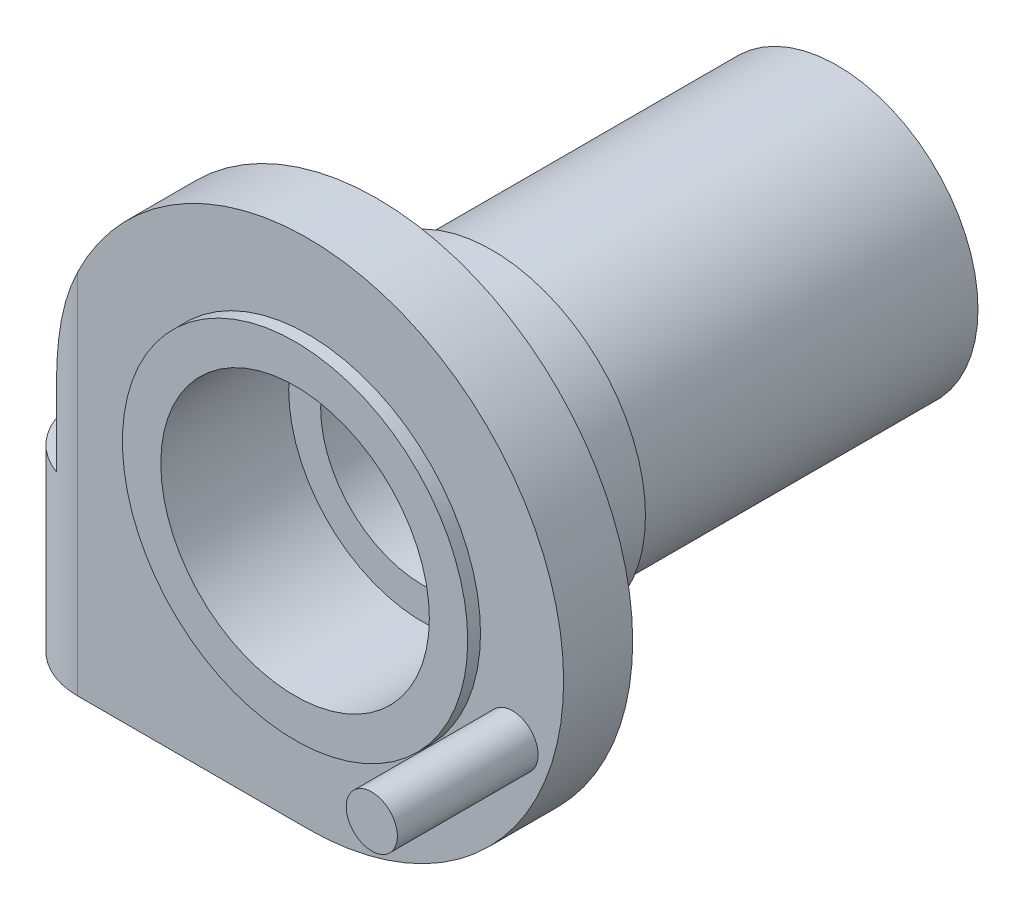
ISO-10303-21;
HEADER;
FILE_DESCRIPTION(('STEP AP214'),'2;1');
FILE_NAME('part.step','',(''),(''),'','','');
FILE_SCHEMA(('AUTOMOTIVE_DESIGN { 1 0 10303 214 1 1 1 1 }'));
ENDSEC;
DATA;
#1=APPLICATION_CONTEXT('core data for automotive mechanical design processes');
#2=APPLICATION_PROTOCOL_DEFINITION('international standard','automotive_design',2000,#1);
#3=PRODUCT_CONTEXT('',#1,'mechanical');
#4=PRODUCT('Part','Part','',(#3));
#5=PRODUCT_RELATED_PRODUCT_CATEGORY('part','',(#4));
#6=PRODUCT_DEFINITION_FORMATION('','',#4);
#7=PRODUCT_DEFINITION_CONTEXT('part definition',#1,'design');
#8=PRODUCT_DEFINITION('design','',#6,#7);
#9=PRODUCT_DEFINITION_SHAPE('','',#8);
#10=(LENGTH_UNIT() NAMED_UNIT(*) SI_UNIT(.MILLI.,.METRE.));
#11=(NAMED_UNIT(*) PLANE_ANGLE_UNIT() SI_UNIT($,.RADIAN.));
#12=(NAMED_UNIT(*) SI_UNIT($,.STERADIAN.) SOLID_ANGLE_UNIT());
#13=UNCERTAINTY_MEASURE_WITH_UNIT(LENGTH_MEASURE(1.E-05),#10,'distance_accuracy_value','');
#14=(GEOMETRIC_REPRESENTATION_CONTEXT(3) GLOBAL_UNCERTAINTY_ASSIGNED_CONTEXT((#13)) GLOBAL_UNIT_ASSIGNED_CONTEXT((#10,
#11,#12)) REPRESENTATION_CONTEXT('',''));
#15=CARTESIAN_POINT('',(0.,0.,0.));
#16=DIRECTION('',(0.,0.,1.));
#17=DIRECTION('',(1.,0.,0.));
#18=AXIS2_PLACEMENT_3D('',#15,#16,#17);
#19=CARTESIAN_POINT('',(0.,0.,20.7));
#20=DIRECTION('',(0.,0.,1.));
#21=DIRECTION('',(1.,0.,0.));
#22=AXIS2_PLACEMENT_3D('',#19,#20,#21);
#23=PLANE('',#22);
#24=CARTESIAN_POINT('',(0.,0.,20.7));
#25=DIRECTION('',(0.,0.,1.));
#26=DIRECTION('',(1.,0.,0.));
#27=AXIS2_PLACEMENT_3D('',#24,#25,#26);
#28=CIRCLE('',#27,6.75);
#29=CARTESIAN_POINT('',(6.75,0.,20.7));
#30=VERTEX_POINT('',#29);
#31=EDGE_CURVE('E165',#30,#30,#28,.T.);
#32=ORIENTED_EDGE('',*,*,#31,.F.);
#33=EDGE_LOOP('',(#32));
#34=FACE_BOUND('',#33,.T.);
#35=CARTESIAN_POINT('',(0.,0.,20.7));
#36=DIRECTION('',(0.,0.,1.));
#37=DIRECTION('',(1.,0.,0.));
#38=AXIS2_PLACEMENT_3D('',#35,#36,#37);
#39=CIRCLE('',#38,10.);
#40=CARTESIAN_POINT('',(0.,-10.,20.7));
#41=VERTEX_POINT('',#40);
#42=CARTESIAN_POINT('',(-9.,4.35889894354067,20.7));
#43=VERTEX_POINT('',#42);
#44=EDGE_CURVE('E179',#41,#43,#39,.T.);
#45=ORIENTED_EDGE('',*,*,#44,.T.);
#46=DIRECTION('',(0.,-1.,0.));
#47=VECTOR('',#46,1.);
#48=CARTESIAN_POINT('',(-9.,-10.,20.7));
#49=LINE('',#48,#47);
#50=CARTESIAN_POINT('',(-9.,-10.,20.7));
#51=VERTEX_POINT('',#50);
#52=EDGE_CURVE('E203',#43,#51,#49,.T.);
#53=ORIENTED_EDGE('',*,*,#52,.T.);
#54=DIRECTION('',(1.,0.,0.));
#55=VECTOR('',#54,1.);
#56=CARTESIAN_POINT('',(0.,-10.,20.7));
#57=LINE('',#56,#55);
#58=EDGE_CURVE('E182',#51,#41,#57,.T.);
#59=ORIENTED_EDGE('',*,*,#58,.T.);
#60=EDGE_LOOP('',(#45,#53,#59));
#61=FACE_BOUND('',#60,.T.);
#62=CARTESIAN_POINT('',(8.,-3.,20.7));
#63=DIRECTION('',(0.,0.,1.));
#64=DIRECTION('',(1.,0.,0.));
#65=AXIS2_PLACEMENT_3D('',#62,#63,#64);
#66=CIRCLE('',#65,1.);
#67=CARTESIAN_POINT('',(9.,-3.,20.7));
#68=VERTEX_POINT('',#67);
#69=EDGE_CURVE('E145',#68,#68,#66,.T.);
#70=ORIENTED_EDGE('',*,*,#69,.F.);
#71=EDGE_LOOP('',(#70));
#72=FACE_BOUND('',#71,.T.);
#73=ADVANCED_FACE('F32',(#34,#61,#72),#23,.T.);
#74=CARTESIAN_POINT('',(0.,0.,21.2));
#75=DIRECTION('',(0.,0.,-1.));
#76=DIRECTION('',(-1.,0.,0.));
#77=AXIS2_PLACEMENT_3D('',#74,#75,#76);
#78=CYLINDRICAL_SURFACE('',#77,4.);
#79=CARTESIAN_POINT('',(0.,0.,0.));
#80=DIRECTION('',(0.,0.,-1.));
#81=DIRECTION('',(-1.,0.,0.));
#82=AXIS2_PLACEMENT_3D('',#79,#80,#81);
#83=CIRCLE('',#82,4.);
#84=CARTESIAN_POINT('',(-4.,0.,0.));
#85=VERTEX_POINT('',#84);
#86=EDGE_CURVE('E162',#85,#85,#83,.T.);
#87=ORIENTED_EDGE('',*,*,#86,.T.);
#88=EDGE_LOOP('',(#87));
#89=FACE_BOUND('',#88,.T.);
#90=CARTESIAN_POINT('',(0.,0.,16.2));
#91=DIRECTION('',(0.,0.,1.));
#92=DIRECTION('',(1.,0.,0.));
#93=AXIS2_PLACEMENT_3D('',#90,#91,#92);
#94=CIRCLE('',#93,4.);
#95=CARTESIAN_POINT('',(4.,0.,16.2));
#96=VERTEX_POINT('',#95);
#97=EDGE_CURVE('E161',#96,#96,#94,.F.);
#98=ORIENTED_EDGE('',*,*,#97,.F.);
#99=EDGE_LOOP('',(#98));
#100=FACE_BOUND('',#99,.T.);
#101=ADVANCED_FACE('F250',(#89,#100),#78,.F.);
#102=CARTESIAN_POINT('',(0.,0.,13.5));
#103=DIRECTION('',(0.,0.,-1.));
#104=DIRECTION('',(-1.,0.,0.));
#105=AXIS2_PLACEMENT_3D('',#102,#103,#104);
#106=CYLINDRICAL_SURFACE('',#105,5.5);
#107=CARTESIAN_POINT('',(0.,0.,13.5));
#108=DIRECTION('',(0.,0.,1.));
#109=DIRECTION('',(1.,0.,0.));
#110=AXIS2_PLACEMENT_3D('',#107,#108,#109);
#111=CIRCLE('',#110,5.5);
#112=CARTESIAN_POINT('',(5.5,0.,13.5));
#113=VERTEX_POINT('',#112);
#114=EDGE_CURVE('E200',#113,#113,#111,.T.);
#115=ORIENTED_EDGE('',*,*,#114,.F.);
#116=EDGE_LOOP('',(#115));
#117=FACE_BOUND('',#116,.T.);
#118=CARTESIAN_POINT('',(0.,0.,0.));
#119=DIRECTION('',(0.,0.,1.));
#120=DIRECTION('',(1.,0.,0.));
#121=AXIS2_PLACEMENT_3D('',#118,#119,#120);
#122=CIRCLE('',#121,5.5);
#123=CARTESIAN_POINT('',(5.5,0.,0.));
#124=VERTEX_POINT('',#123);
#125=EDGE_CURVE('E197',#124,#124,#122,.T.);
#126=ORIENTED_EDGE('',*,*,#125,.T.);
#127=EDGE_LOOP('',(#126));
#128=FACE_BOUND('',#127,.T.);
#129=ADVANCED_FACE('F247',(#117,#128),#106,.T.);
#130=CARTESIAN_POINT('',(0.,0.,0.));
#131=DIRECTION('',(0.,0.,1.));
#132=DIRECTION('',(1.,0.,0.));
#133=AXIS2_PLACEMENT_3D('',#130,#131,#132);
#134=PLANE('',#133);
#135=ORIENTED_EDGE('',*,*,#86,.F.);
#136=EDGE_LOOP('',(#135));
#137=FACE_BOUND('',#136,.T.);
#138=ORIENTED_EDGE('',*,*,#125,.F.);
#139=EDGE_LOOP('',(#138));
#140=FACE_BOUND('',#139,.T.);
#141=ADVANCED_FACE('F241',(#137,#140),#134,.F.);
#142=CARTESIAN_POINT('',(0.,0.,13.5));
#143=DIRECTION('',(0.,0.,1.));
#144=DIRECTION('',(1.,0.,0.));
#145=AXIS2_PLACEMENT_3D('',#142,#143,#144);
#146=PLANE('',#145);
#147=CARTESIAN_POINT('',(0.,0.,13.5));
#148=DIRECTION('',(0.,0.,1.));
#149=DIRECTION('',(1.,0.,0.));
#150=AXIS2_PLACEMENT_3D('',#147,#148,#149);
#151=CIRCLE('',#150,6.);
#152=CARTESIAN_POINT('',(6.,0.,13.5));
#153=VERTEX_POINT('',#152);
#154=EDGE_CURVE('E191',#153,#153,#151,.T.);
#155=ORIENTED_EDGE('',*,*,#154,.F.);
#156=EDGE_LOOP('',(#155));
#157=FACE_BOUND('',#156,.T.);
#158=ORIENTED_EDGE('',*,*,#114,.T.);
#159=EDGE_LOOP('',(#158));
#160=FACE_BOUND('',#159,.T.);
#161=ADVANCED_FACE('F237',(#157,#160),#146,.F.);
#162=CARTESIAN_POINT('',(0.,0.,18.));
#163=DIRECTION('',(0.,0.,-1.));
#164=DIRECTION('',(-1.,0.,0.));
#165=AXIS2_PLACEMENT_3D('',#162,#163,#164);
#166=CYLINDRICAL_SURFACE('',#165,6.);
#167=CARTESIAN_POINT('',(0.,0.,18.));
#168=DIRECTION('',(0.,0.,1.));
#169=DIRECTION('',(1.,0.,0.));
#170=AXIS2_PLACEMENT_3D('',#167,#168,#169);
#171=CIRCLE('',#170,6.);
#172=CARTESIAN_POINT('',(6.,0.,18.));
#173=VERTEX_POINT('',#172);
#174=EDGE_CURVE('E194',#173,#173,#171,.T.);
#175=ORIENTED_EDGE('',*,*,#174,.F.);
#176=EDGE_LOOP('',(#175));
#177=FACE_BOUND('',#176,.T.);
#178=ORIENTED_EDGE('',*,*,#154,.T.);
#179=EDGE_LOOP('',(#178));
#180=FACE_BOUND('',#179,.T.);
#181=ADVANCED_FACE('F240',(#177,#180),#166,.T.);
#182=CARTESIAN_POINT('',(0.,0.,18.));
#183=DIRECTION('',(0.,0.,1.));
#184=DIRECTION('',(1.,0.,0.));
#185=AXIS2_PLACEMENT_3D('',#182,#183,#184);
#186=PLANE('',#185);
#187=DIRECTION('',(1.,0.,0.));
#188=VECTOR('',#187,1.);
#189=CARTESIAN_POINT('',(0.,-10.,18.));
#190=LINE('',#189,#188);
#191=CARTESIAN_POINT('',(-8.3,-10.,18.));
#192=VERTEX_POINT('',#191);
#193=CARTESIAN_POINT('',(0.,-10.,18.));
#194=VERTEX_POINT('',#193);
#195=EDGE_CURVE('E177',#192,#194,#190,.T.);
#196=ORIENTED_EDGE('',*,*,#195,.F.);
#197=DIRECTION('',(0.,1.,0.));
#198=VECTOR('',#197,1.);
#199=CARTESIAN_POINT('',(-8.3,-3.,18.));
#200=LINE('',#199,#198);
#201=CARTESIAN_POINT('',(-8.3,-7.8228756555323,18.));
#202=VERTEX_POINT('',#201);
#203=EDGE_CURVE('E314',#192,#202,#200,.T.);
#204=ORIENTED_EDGE('',*,*,#203,.T.);
#205=CARTESIAN_POINT('',(-9.3,-9.09807621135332,18.));
#206=CARTESIAN_POINT('',(-9.3,-8.52072594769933,18.));
#207=CARTESIAN_POINT('',(-9.3,-8.23205081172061,17.500000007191));
#208=CARTESIAN_POINT('',(-9.3,-7.94337567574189,17.000000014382));
#209=CARTESIAN_POINT('',(-9.3,-8.23205079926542,16.500000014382));
#210=CARTESIAN_POINT('',(-9.24973436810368,-9.098142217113,18.));
#211=CARTESIAN_POINT('',(-9.28328284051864,-8.5206721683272,18.));
#212=CARTESIAN_POINT('',(-9.30004211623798,-8.23196850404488,17.4999936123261));
#213=CARTESIAN_POINT('',(-9.31679690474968,-7.94326503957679,16.9999903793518));
#214=CARTESIAN_POINT('',(-9.3,-8.23204479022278,16.499996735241));
#215=CARTESIAN_POINT('',(-9.19951082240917,-9.09370494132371,18.));
#216=CARTESIAN_POINT('',(-9.26651845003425,-8.5197550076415,18.));
#217=CARTESIAN_POINT('',(-9.30000861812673,-8.23241542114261,17.5006309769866));
#218=CARTESIAN_POINT('',(-9.3334978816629,-7.94507524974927,17.0012617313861));
#219=CARTESIAN_POINT('',(-9.3,-8.23132186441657,16.5012620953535));
#220=CARTESIAN_POINT('',(-9.10069781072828,-9.07633904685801,18.));
#221=CARTESIAN_POINT('',(-9.2325639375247,-8.51579118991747,18.));
#222=CARTESIAN_POINT('',(-9.29886450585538,-8.23373908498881,17.5031421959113));
#223=CARTESIAN_POINT('',(-9.36516693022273,-7.95168645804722,17.0062825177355));
#224=CARTESIAN_POINT('',(-9.3,-8.22840362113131,16.5062984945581));
#225=CARTESIAN_POINT('',(-9.05210401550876,-9.06343517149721,18.));
#226=CARTESIAN_POINT('',(-9.21538953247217,-8.51275413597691,18.));
#227=CARTESIAN_POINT('',(-9.29775702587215,-8.23461457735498,17.5050124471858));
#228=CARTESIAN_POINT('',(-9.38012829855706,-7.95647353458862,17.010020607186));
#229=CARTESIAN_POINT('',(-9.3,-8.22621259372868,16.5100622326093));
#230=CARTESIAN_POINT('',(-8.95781187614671,-9.02965318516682,18.));
#231=CARTESIAN_POINT('',(-9.18022784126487,-8.50417057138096,18.));
#232=CARTESIAN_POINT('',(-9.29355097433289,-8.23617323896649,17.509937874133));
#233=CARTESIAN_POINT('',(-9.40687719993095,-7.96817484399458,17.0198719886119));
#234=CARTESIAN_POINT('',(-9.3,-8.22032130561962,16.520061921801));
#235=CARTESIAN_POINT('',(-8.91211229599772,-9.00877850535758,18.));
#236=CARTESIAN_POINT('',(-9.16225598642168,-8.49863258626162,18.));
#237=CARTESIAN_POINT('',(-9.29045325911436,-8.23685649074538,17.5129925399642));
#238=CARTESIAN_POINT('',(-9.41866080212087,-7.97508011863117,17.0259765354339));
#239=CARTESIAN_POINT('',(-9.3,-8.21662169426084,16.5262968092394));
#240=CARTESIAN_POINT('',(-8.82470633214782,-8.95992663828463,18.));
#241=CARTESIAN_POINT('',(-9.12547736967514,-8.48443811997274,18.));
#242=CARTESIAN_POINT('',(-9.28181473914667,-8.23701278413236,17.5202015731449));
#243=CARTESIAN_POINT('',(-9.43816236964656,-7.98958735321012,17.0403945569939));
#244=CARTESIAN_POINT('',(-9.3,-8.20762782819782,16.5411932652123));
#245=CARTESIAN_POINT('',(-8.78300000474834,-8.93194935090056,18.));
#246=CARTESIAN_POINT('',(-9.10668572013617,-8.47579406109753,18.));
#247=CARTESIAN_POINT('',(-9.27627389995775,-8.23648580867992,17.5243559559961));
#248=CARTESIAN_POINT('',(-9.44588294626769,-7.99718248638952,17.0486976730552));
#249=CARTESIAN_POINT('',(-9.3,-8.20233355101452,16.5498548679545));
#250=CARTESIAN_POINT('',(-8.70297582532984,-8.86878298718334,18.));
#251=CARTESIAN_POINT('',(-9.06783988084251,-8.45443218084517,18.));
#252=CARTESIAN_POINT('',(-9.2624673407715,-8.23310993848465,17.53383267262));
#253=CARTESIAN_POINT('',(-9.45711672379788,-8.01179323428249,17.0676502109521));
#254=CARTESIAN_POINT('',(-9.3,-8.18980506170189,16.5699082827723));
#255=CARTESIAN_POINT('',(-8.66483684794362,-8.8333682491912,18.));
#256=CARTESIAN_POINT('',(-9.04777758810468,-8.44159573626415,18.));
#257=CARTESIAN_POINT('',(-9.25410967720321,-8.23017712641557,17.5391920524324));
#258=CARTESIAN_POINT('',(-9.46047779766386,-8.01877627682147,17.0783620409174));
#259=CARTESIAN_POINT('',(-9.3,-8.18250718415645,16.5813880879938));
#260=CARTESIAN_POINT('',(-8.59426437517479,-8.75719541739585,18.));
#261=CARTESIAN_POINT('',(-9.0075799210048,-8.41146230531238,18.));
#262=CARTESIAN_POINT('',(-9.23511204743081,-8.22083221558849,17.5508627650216));
#263=CARTESIAN_POINT('',(-9.46267989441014,-8.03021966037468,17.101703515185));
#264=CARTESIAN_POINT('',(-9.3,-8.16587980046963,16.6068314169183));
#265=CARTESIAN_POINT('',(-8.56183916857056,-8.71642970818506,18.));
#266=CARTESIAN_POINT('',(-8.98745637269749,-8.39418446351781,18.));
#267=CARTESIAN_POINT('',(-9.22446881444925,-8.21441511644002,17.5571754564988));
#268=CARTESIAN_POINT('',(-9.46153082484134,-8.03468256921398,17.1143219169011));
#269=CARTESIAN_POINT('',(-9.3,-8.15654738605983,16.6207984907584));
#270=CARTESIAN_POINT('',(-8.49953607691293,-8.62577320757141,18.));
#271=CARTESIAN_POINT('',(-8.94554743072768,-8.35264671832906,18.));
#272=CARTESIAN_POINT('',(-9.2002361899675,-8.19630455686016,17.5714043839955));
#273=CARTESIAN_POINT('',(-9.45498588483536,-8.04000820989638,17.1427728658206));
#274=CARTESIAN_POINT('',(-9.3,-8.13439931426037,16.652893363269));
#275=CARTESIAN_POINT('',(-8.47040278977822,-8.57537293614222,18.));
#276=CARTESIAN_POINT('',(-8.92384125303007,-8.32783329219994,18.));
#277=CARTESIAN_POINT('',(-9.18644767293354,-8.18408060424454,17.579421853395));
#278=CARTESIAN_POINT('',(-9.44913000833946,-8.04040933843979,17.1587987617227));
#279=CARTESIAN_POINT('',(-9.3,-8.12130352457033,16.6713170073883));
#280=CARTESIAN_POINT('',(-8.41961134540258,-8.47112959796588,18.));
#281=CARTESIAN_POINT('',(-8.88227881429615,-8.27246106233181,18.));
#282=CARTESIAN_POINT('',(-9.15802400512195,-8.15368016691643,17.5962644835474));
#283=CARTESIAN_POINT('',(-9.43384403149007,-8.03497908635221,17.1924845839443));
#284=CARTESIAN_POINT('',(-9.3,-8.09194100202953,16.7109213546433));
#285=CARTESIAN_POINT('',(-8.39793569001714,-8.41729494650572,18.));
#286=CARTESIAN_POINT('',(-8.86241895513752,-8.24195993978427,18.));
#287=CARTESIAN_POINT('',(-9.14339093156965,-8.13551781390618,17.6050876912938));
#288=CARTESIAN_POINT('',(-9.42444498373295,-8.02919650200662,17.210123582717));
#289=CARTESIAN_POINT('',(-9.3,-8.07568183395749,16.7320954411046));
#290=CARTESIAN_POINT('',(-8.36554004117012,-8.31947268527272,18.));
#291=CARTESIAN_POINT('',(-8.82937164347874,-8.1828193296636,18.));
#292=CARTESIAN_POINT('',(-9.11752593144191,-8.09769481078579,17.6213551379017));
#293=CARTESIAN_POINT('',(-9.40573049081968,-8.01264318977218,17.2426787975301));
#294=CARTESIAN_POINT('',(-9.3,-8.04349006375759,16.7720625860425));
#295=CARTESIAN_POINT('',(-8.35345895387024,-8.27592383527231,18.));
#296=CARTESIAN_POINT('',(-8.81568894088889,-8.15529743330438,18.));
#297=CARTESIAN_POINT('',(-9.10625388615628,-8.07924250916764,17.6286757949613));
#298=CARTESIAN_POINT('',(-9.39686919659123,-8.0032805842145,17.2573173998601));
#299=CARTESIAN_POINT('',(-9.3,-8.02827232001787,16.7903548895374));
#300=CARTESIAN_POINT('',(-8.33320530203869,-8.18789602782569,18.));
#301=CARTESIAN_POINT('',(-8.79017126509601,-8.09718511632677,18.));
#302=CARTESIAN_POINT('',(-9.08425552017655,-8.03858115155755,17.6436199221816));
#303=CARTESIAN_POINT('',(-9.3783898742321,-7.98006988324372,17.2872057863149));
#304=CARTESIAN_POINT('',(-9.3,-7.99533805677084,16.828381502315));
#305=CARTESIAN_POINT('',(-8.32503595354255,-8.14341633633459,18.));
#306=CARTESIAN_POINT('',(-8.77833121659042,-8.06661029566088,18.));
#307=CARTESIAN_POINT('',(-9.07352965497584,-8.01636902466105,17.6512436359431));
#308=CARTESIAN_POINT('',(-9.36877598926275,-7.96624018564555,17.3024511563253));
#309=CARTESIAN_POINT('',(-9.3,-7.97761949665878,16.8481169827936));
#310=CARTESIAN_POINT('',(-8.3122112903,-8.05363212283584,18.));
#311=CARTESIAN_POINT('',(-8.75661590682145,-8.00245933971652,18.));
#312=CARTESIAN_POINT('',(-9.05291475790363,-7.96811425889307,17.6667502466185));
#313=CARTESIAN_POINT('',(-9.34926205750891,-7.9338822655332,17.3334641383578));
#314=CARTESIAN_POINT('',(-9.3,-7.93926935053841,16.8889908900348));
#315=CARTESIAN_POINT('',(-8.30758225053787,-8.00832394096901,18.));
#316=CARTESIAN_POINT('',(-8.74674668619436,-7.9688776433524,18.));
#317=CARTESIAN_POINT('',(-9.04303245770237,-7.9420446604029,17.6746346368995));
#318=CARTESIAN_POINT('',(-9.33936198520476,-7.915342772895,17.3492319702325));
#319=CARTESIAN_POINT('',(-9.3,-7.91861730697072,16.9101385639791));
#320=CARTESIAN_POINT('',(-8.30151633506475,-7.91755351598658,18.));
#321=CARTESIAN_POINT('',(-8.72916274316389,-7.89923963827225,18.));
#322=CARTESIAN_POINT('',(-9.02446229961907,-7.88637138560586,17.6904960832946));
#323=CARTESIAN_POINT('',(-9.31980563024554,-7.87363445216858,17.3809547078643));
#324=CARTESIAN_POINT('',(-9.3,-7.87421258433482,16.9534433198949));
#325=CARTESIAN_POINT('',(-8.30007613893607,-7.87209148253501,18.));
#326=CARTESIAN_POINT('',(-8.72143601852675,-7.86319878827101,18.));
#327=CARTESIAN_POINT('',(-9.01577320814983,-7.8567714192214,17.6984730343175));
#328=CARTESIAN_POINT('',(-9.31014831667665,-7.85049289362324,17.3969079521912));
#329=CARTESIAN_POINT('',(-9.3,-7.85046315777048,16.9755993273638));
#330=CARTESIAN_POINT('',(-8.2998516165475,-7.73236502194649,18.));
#331=CARTESIAN_POINT('',(-8.70102056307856,-7.74925736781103,18.));
#332=CARTESIAN_POINT('',(-8.99116536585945,-7.76054979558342,17.7229850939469));
#333=CARTESIAN_POINT('',(-9.28146941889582,-7.77246374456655,17.4458122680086));
#334=CARTESIAN_POINT('',(-9.3,-7.77215123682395,17.0448733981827));
#335=CARTESIAN_POINT('',(-8.30557787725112,-7.6381002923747,18.));
#336=CARTESIAN_POINT('',(-8.69173617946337,-7.66742035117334,18.));
#337=CARTESIAN_POINT('',(-8.9774985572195,-7.68829561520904,17.7395149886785));
#338=CARTESIAN_POINT('',(-9.26335425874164,-7.70989394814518,17.4788845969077));
#339=CARTESIAN_POINT('',(-9.3,-7.71187919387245,17.0932562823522));
#340=CARTESIAN_POINT('',(-8.32435434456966,-7.4502149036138,18.));
#341=CARTESIAN_POINT('',(-8.68099493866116,-7.49592563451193,18.));
#342=CARTESIAN_POINT('',(-8.95630719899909,-7.53036579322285,17.7714197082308));
#343=CARTESIAN_POINT('',(-9.23171868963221,-7.56551807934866,17.5426948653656));
#344=CARTESIAN_POINT('',(-9.3,-7.57338057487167,17.1896673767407));
#345=CARTESIAN_POINT('',(-8.33742417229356,-7.35659665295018,18.));
#346=CARTESIAN_POINT('',(-8.6794836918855,-7.4062450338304,18.));
#347=CARTESIAN_POINT('',(-8.94879923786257,-7.44465464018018,17.7867913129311));
#348=CARTESIAN_POINT('',(-9.21815561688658,-7.48377328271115,17.5734747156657));
#349=CARTESIAN_POINT('',(-9.3,-7.49510623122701,17.2376942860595));
#350=CARTESIAN_POINT('',(-8.35865089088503,-7.2165077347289,18.));
#351=CARTESIAN_POINT('',(-8.68088450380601,-7.26671973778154,18.));
#352=CARTESIAN_POINT('',(-8.94123272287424,-7.30711492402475,17.8077915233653));
#353=CARTESIAN_POINT('',(-9.20159000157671,-7.34769127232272,17.6155552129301));
#354=CARTESIAN_POINT('',(-9.3,-7.36288394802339,17.3049537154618));
#355=CARTESIAN_POINT('',(-8.36599092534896,-7.1699012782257,18.));
#356=CARTESIAN_POINT('',(-8.68195228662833,-7.21953042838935,18.));
#357=CARTESIAN_POINT('',(-8.93932650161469,-7.25981013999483,17.8144446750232));
#358=CARTESIAN_POINT('',(-9.19670539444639,-7.30025698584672,17.6288680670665));
#359=CARTESIAN_POINT('',(-9.3,-7.31638019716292,17.3265628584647));
#360=CARTESIAN_POINT('',(-8.38049420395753,-7.07666116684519,18.));
#361=CARTESIAN_POINT('',(-8.68480874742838,-7.12367234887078,18.));
#362=CARTESIAN_POINT('',(-8.93646741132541,-7.16240268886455,17.8268379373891));
#363=CARTESIAN_POINT('',(-9.18813112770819,-7.20129742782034,17.6536549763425));
#364=CARTESIAN_POINT('',(-9.3,-7.21847416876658,17.3672457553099));
#365=CARTESIAN_POINT('',(-8.38765745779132,-7.03002751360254,18.));
#366=CARTESIAN_POINT('',(-8.68659567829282,-7.07498391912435,18.));
#367=CARTESIAN_POINT('',(-8.93551448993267,-7.11230017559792,17.8325780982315));
#368=CARTESIAN_POINT('',(-9.18443513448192,-7.14976069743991,17.6651417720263));
#369=CARTESIAN_POINT('',(-9.3,-7.16707216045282,17.3863196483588));
#370=CARTESIAN_POINT('',(-8.40105233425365,-6.93674234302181,18.));
#371=CARTESIAN_POINT('',(-8.69036846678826,-6.97640564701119,18.));
#372=CARTESIAN_POINT('',(-8.93426020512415,-7.00972407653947,17.8428904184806));
#373=CARTESIAN_POINT('',(-9.17815363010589,-7.04318604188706,17.6857663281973));
#374=CARTESIAN_POINT('',(-9.3,-7.05982154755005,17.420875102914));
#375=CARTESIAN_POINT('',(-8.40728626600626,-6.8900911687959,18.));
#376=CARTESIAN_POINT('',(-8.69235442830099,-6.92649187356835,18.));
#377=CARTESIAN_POINT('',(-8.93395720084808,-6.95725680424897,17.847465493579));
#378=CARTESIAN_POINT('',(-9.17556029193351,-6.98813393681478,17.694922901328));
#379=CARTESIAN_POINT('',(-9.3,-7.00398451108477,17.4363656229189));
#380=CARTESIAN_POINT('',(-8.41812816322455,-6.79659705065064,18.));
#381=CARTESIAN_POINT('',(-8.69601078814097,-6.82559276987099,18.));
#382=CARTESIAN_POINT('',(-8.93368091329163,-6.85030705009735,17.8552261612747));
#383=CARTESIAN_POINT('',(-9.17135129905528,-6.87513329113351,17.7104441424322));
#384=CARTESIAN_POINT('',(-9.3,-6.88851764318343,17.4627932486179));
#385=CARTESIAN_POINT('',(-8.42273629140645,-6.7497541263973,18.));
#386=CARTESIAN_POINT('',(-8.6976832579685,-6.77457170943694,18.));
#387=CARTESIAN_POINT('',(-8.93370759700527,-6.79582477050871,17.85841189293));
#388=CARTESIAN_POINT('',(-9.16973191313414,-6.81714845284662,17.7168207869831));
#389=CARTESIAN_POINT('',(-9.3,-6.82888819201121,17.4737308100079));
#390=CARTESIAN_POINT('',(-8.42976217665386,-6.65553043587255,18.));
#391=CARTESIAN_POINT('',(-8.70029068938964,-6.67143033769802,18.));
#392=CARTESIAN_POINT('',(-8.93382145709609,-6.68510359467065,17.8632126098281));
#393=CARTESIAN_POINT('',(-9.16735210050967,-6.69884906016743,17.7264220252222));
#394=CARTESIAN_POINT('',(-9.3,-6.70662659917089,17.490260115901));
#395=CARTESIAN_POINT('',(-8.43216263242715,-6.60814831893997,18.));
#396=CARTESIAN_POINT('',(-8.70122194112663,-6.61926015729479,18.));
#397=CARTESIAN_POINT('',(-8.93390910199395,-6.62885433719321,17.8648151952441));
#398=CARTESIAN_POINT('',(-9.16659626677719,-6.63847036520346,17.7296301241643));
#399=CARTESIAN_POINT('',(-9.3,-6.64397472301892,17.4958096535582));
#400=CARTESIAN_POINT('',(-8.43436962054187,-6.51332369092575,18.));
#401=CARTESIAN_POINT('',(-8.7020759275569,-6.51472932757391,18.));
#402=CARTESIAN_POINT('',(-8.93398794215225,-6.5159311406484,17.8662899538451));
#403=CARTESIAN_POINT('',(-9.16589992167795,-6.51715573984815,17.732579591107));
#404=CARTESIAN_POINT('',(-9.3,-6.51785535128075,17.500915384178));
#405=CARTESIAN_POINT('',(-8.43417631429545,-6.46588118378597,18.));
#406=CARTESIAN_POINT('',(-8.70199951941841,-6.46232030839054,18.));
#407=CARTESIAN_POINT('',(-8.93397914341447,-6.45925722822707,17.8661622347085));
#408=CARTESIAN_POINT('',(-9.16595871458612,-6.45616382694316,17.7323239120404));
#409=CARTESIAN_POINT('',(-9.3,-6.45438790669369,17.5004719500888));
#410=CARTESIAN_POINT('',(-8.43122217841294,-6.37100623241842,18.));
#411=CARTESIAN_POINT('',(-8.70086007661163,-6.35779212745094,18.));
#412=CARTESIAN_POINT('',(-8.93387811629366,-6.34639361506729,17.8641847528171));
#413=CARTESIAN_POINT('',(-9.16689615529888,-6.33496559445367,17.728369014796));
#414=CARTESIAN_POINT('',(-9.3,-6.32844940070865,17.4936287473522));
#415=CARTESIAN_POINT('',(-8.42845735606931,-6.32357391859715,18.));
#416=CARTESIAN_POINT('',(-8.6997944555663,-6.30562538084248,18.));
#417=CARTESIAN_POINT('',(-8.93378575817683,-6.29020480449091,17.8623323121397));
#418=CARTESIAN_POINT('',(-9.16777694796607,-6.27470504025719,17.7246607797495));
#419=CARTESIAN_POINT('',(-9.3,-6.26598004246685,17.4872197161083));
#420=CARTESIAN_POINT('',(-8.42074460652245,-6.22888869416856,18.));
#421=CARTESIAN_POINT('',(-8.69696165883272,-6.20215080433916,18.));
#422=CARTESIAN_POINT('',(-8.93369719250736,-6.17929227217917,17.8570340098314));
#423=CARTESIAN_POINT('',(-9.17043271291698,-6.15635493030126,17.714064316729));
#424=CARTESIAN_POINT('',(-9.3,-6.14383442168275,17.4690008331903));
#425=CARTESIAN_POINT('',(-8.41579637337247,-6.18163580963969,18.));
#426=CARTESIAN_POINT('',(-8.69519216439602,-6.15079979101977,18.));
#427=CARTESIAN_POINT('',(-8.93370099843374,-6.12456875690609,17.8535879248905));
#428=CARTESIAN_POINT('',(-9.17221022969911,-6.09821784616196,17.7071665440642));
#429=CARTESIAN_POINT('',(-9.3,-6.08415855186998,17.4571902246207));
#430=CARTESIAN_POINT('',(-8.40432636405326,-6.08709656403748,18.));
#431=CARTESIAN_POINT('',(-8.69140687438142,-6.04906617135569,18.));
#432=CARTESIAN_POINT('',(-8.93409511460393,-6.01700997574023,17.8452977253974));
#433=CARTESIAN_POINT('',(-9.17678384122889,-5.98483258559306,17.6905861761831));
#434=CARTESIAN_POINT('',(-9.3,-5.96855432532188,17.4290222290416));
#435=CARTESIAN_POINT('',(-8.39779706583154,-6.03981115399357,18.));
#436=CARTESIAN_POINT('',(-8.68938796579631,-5.99865404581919,18.));
#437=CARTESIAN_POINT('',(-8.93448730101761,-5.96418516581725,17.8404469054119));
#438=CARTESIAN_POINT('',(-9.17958884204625,-5.92956442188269,17.6808777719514));
#439=CARTESIAN_POINT('',(-9.3,-5.91264556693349,17.4126430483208));
#440=CARTESIAN_POINT('',(-8.38393252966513,-5.94536137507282,18.));
#441=CARTESIAN_POINT('',(-8.6856517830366,-5.89927173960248,18.));
#442=CARTESIAN_POINT('',(-8.93599231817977,-5.86115661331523,17.8296062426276));
#443=CARTESIAN_POINT('',(-9.18633509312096,-5.82288902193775,17.6591965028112));
#444=CARTESIAN_POINT('',(-9.3,-5.80560111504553,17.3764344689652));
#445=CARTESIAN_POINT('',(-8.37659726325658,-5.8981970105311,18.));
#446=CARTESIAN_POINT('',(-8.68393422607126,-5.85027430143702,18.));
#447=CARTESIAN_POINT('',(-8.93710517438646,-5.81095296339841,17.8236163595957));
#448=CARTESIAN_POINT('',(-9.19028189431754,-5.77145946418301,17.6472099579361));
#449=CARTESIAN_POINT('',(-9.3,-5.75446559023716,17.3566049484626));
#450=CARTESIAN_POINT('',(-8.36188900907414,-5.80390183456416,18.));
#451=CARTESIAN_POINT('',(-8.68133082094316,-5.75388590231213,18.));
#452=CARTESIAN_POINT('',(-8.94036184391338,-5.7134833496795,17.8107516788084));
#453=CARTESIAN_POINT('',(-9.19939862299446,-5.67290794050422,17.621480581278));
#454=CARTESIAN_POINT('',(-9.3,-5.65726729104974,17.3145539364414));
#455=CARTESIAN_POINT('',(-8.35451604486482,-5.75677101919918,18.));
#456=CARTESIAN_POINT('',(-8.6804467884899,-5.70647502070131,18.));
#457=CARTESIAN_POINT('',(-8.942505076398,-5.6662157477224,17.8038773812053));
#458=CARTESIAN_POINT('',(-9.20457454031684,-5.62577356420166,17.6077259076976));
#459=CARTESIAN_POINT('',(-9.3,-5.61120167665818,17.2923337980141));
#460=CARTESIAN_POINT('',(-8.34045389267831,-5.66240787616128,18.));
#461=CARTESIAN_POINT('',(-8.67998145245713,-5.61334780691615,18.));
#462=CARTESIAN_POINT('',(-8.94807855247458,-5.57478801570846,17.7894717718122));
#463=CARTESIAN_POINT('',(-9.21618682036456,-5.5360446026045,17.5789146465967));
#464=CARTESIAN_POINT('',(-9.3,-5.52408202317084,17.2464277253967));
#465=CARTESIAN_POINT('',(-8.33376463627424,-5.6151755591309,18.));
#466=CARTESIAN_POINT('',(-8.68040517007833,-5.56761983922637,18.));
#467=CARTESIAN_POINT('',(-8.95150866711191,-5.53062757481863,17.7819405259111));
#468=CARTESIAN_POINT('',(-9.22263040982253,-5.493450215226,17.5638472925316));
#469=CARTESIAN_POINT('',(-9.3,-5.48302748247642,17.2227419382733));
#470=CARTESIAN_POINT('',(-8.32444238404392,-5.54178354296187,18.));
#471=CARTESIAN_POINT('',(-8.68237485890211,-5.49818148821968,18.));
#472=CARTESIAN_POINT('',(-8.95796574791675,-5.46467062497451,17.7699079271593));
#473=CARTESIAN_POINT('',(-9.23356212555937,-5.43110299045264,17.539805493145));
#474=CARTESIAN_POINT('',(-9.3,-5.42306613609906,17.1854797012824));
#475=CARTESIAN_POINT('',(-8.32133673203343,-5.51568480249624,18.));
#476=CARTESIAN_POINT('',(-8.68333436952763,-5.47376574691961,18.));
#477=CARTESIAN_POINT('',(-8.96048215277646,-5.44173588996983,17.7655645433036));
#478=CARTESIAN_POINT('',(-9.23763677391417,-5.40965011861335,17.5311181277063));
#479=CARTESIAN_POINT('',(-9.3,-5.40249196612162,17.1721394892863));
#480=CARTESIAN_POINT('',(-8.31564306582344,-5.46342774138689,18.));
#481=CARTESIAN_POINT('',(-8.68582220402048,-5.4255133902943,18.));
#482=CARTESIAN_POINT('',(-8.96597790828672,-5.39688276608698,17.7567698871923));
#483=CARTESIAN_POINT('',(-9.24614049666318,-5.36819606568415,17.5135287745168));
#484=CARTESIAN_POINT('',(-9.3,-5.36274189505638,17.1453626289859));
#485=CARTESIAN_POINT('',(-8.31305512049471,-5.43726941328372,18.));
#486=CARTESIAN_POINT('',(-8.68735211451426,-5.40167661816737,18.));
#487=CARTESIAN_POINT('',(-8.96895732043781,-5.37496451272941,17.7523186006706));
#488=CARTESIAN_POINT('',(-9.25057080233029,-5.3481972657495,17.5046256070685));
#489=CARTESIAN_POINT('',(-9.3,-5.34356618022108,17.1319259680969));
#490=CARTESIAN_POINT('',(-8.30623202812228,-5.35879745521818,18.));
#491=CARTESIAN_POINT('',(-8.69286977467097,-5.33107632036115,18.));
#492=CARTESIAN_POINT('',(-8.97859857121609,-5.31085147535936,17.7388623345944));
#493=CARTESIAN_POINT('',(-9.26436036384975,-5.2904074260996,17.4776787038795));
#494=CARTESIAN_POINT('',(-9.3,-5.28811804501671,17.0916748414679));
#495=CARTESIAN_POINT('',(-8.30292537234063,-5.30639609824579,18.));
#496=CARTESIAN_POINT('',(-8.69778362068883,-5.28531912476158,18.));
#497=CARTESIAN_POINT('',(-8.98597131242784,-5.27021666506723,17.7297398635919));
#498=CARTESIAN_POINT('',(-9.27420330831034,-5.25491011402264,17.4594309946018));
#499=CARTESIAN_POINT('',(-9.3,-5.2538508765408,17.0648724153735));
#500=CARTESIAN_POINT('',(-8.29957788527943,-5.20166976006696,18.));
#501=CARTESIAN_POINT('',(-8.71031294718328,-5.19673382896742,18.));
#502=CARTESIAN_POINT('',(-9.00256337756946,-5.19349753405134,17.7114227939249));
#503=CARTESIAN_POINT('',(-9.29485782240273,-5.19005695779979,17.4227968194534));
#504=CARTESIAN_POINT('',(-9.3,-5.19029703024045,17.012077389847));
#505=CARTESIAN_POINT('',(-8.29952506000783,-5.14934520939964,18.));
#506=CARTESIAN_POINT('',(-8.71793365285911,-5.15390475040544,18.));
#507=CARTESIAN_POINT('',(-9.01177579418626,-5.15739699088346,17.7022285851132));
#508=CARTESIAN_POINT('',(-9.30567231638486,-5.16070692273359,17.4044077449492));
#509=CARTESIAN_POINT('',(-9.3,-5.16099245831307,16.9860821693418));
#510=CARTESIAN_POINT('',(-8.30337409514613,-5.04480789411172,18.));
#511=CARTESIAN_POINT('',(-8.73599313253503,-5.07135775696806,18.));
#512=CARTESIAN_POINT('',(-9.03188928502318,-5.08980452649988,17.6839097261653));
#513=CARTESIAN_POINT('',(-9.32783986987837,-5.10806792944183,17.3677697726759));
#514=CARTESIAN_POINT('',(-9.3,-5.10669308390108,16.9352972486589));
#515=CARTESIAN_POINT('',(-8.30727686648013,-4.99259515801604,18.));
#516=CARTESIAN_POINT('',(-8.74644788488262,-5.03165751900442,18.));
#517=CARTESIAN_POINT('',(-9.04279074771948,-5.05831366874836,17.674785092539));
#518=CARTESIAN_POINT('',(-9.33919597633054,-5.08481337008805,17.3495216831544));
#519=CARTESIAN_POINT('',(-9.3,-5.08169927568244,16.9105078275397));
#520=CARTESIAN_POINT('',(-8.31805485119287,-4.90246889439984,18.));
#521=CARTESIAN_POINT('',(-8.7669650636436,-4.9659071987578,18.));
#522=CARTESIAN_POINT('',(-9.06286561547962,-5.00788334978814,17.6591555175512));
#523=CARTESIAN_POINT('',(-9.35880006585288,-5.04977418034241,17.3182846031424));
#524=CARTESIAN_POINT('',(-9.3,-5.04166050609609,16.8688841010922));
#525=CARTESIAN_POINT('',(-8.32386931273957,-4.86443001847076,18.));
#526=CARTESIAN_POINT('',(-8.7764155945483,-4.93900248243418,18.));
#527=CARTESIAN_POINT('',(-9.07173221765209,-4.98782837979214,17.6525966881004));
#528=CARTESIAN_POINT('',(-9.36708435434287,-5.036580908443,17.3051681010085));
#529=CARTESIAN_POINT('',(-9.3,-5.02573362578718,16.8516814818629));
#530=CARTESIAN_POINT('',(-8.33822099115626,-4.78888357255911,18.));
#531=CARTESIAN_POINT('',(-8.79671367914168,-4.88729686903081,18.));
#532=CARTESIAN_POINT('',(-9.08998256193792,-4.95040968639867,17.63966662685));
#533=CARTESIAN_POINT('',(-9.38328760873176,-5.01344891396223,17.2793077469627));
#534=CARTESIAN_POINT('',(-9.3,-4.99577741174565,16.818262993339));
#535=CARTESIAN_POINT('',(-8.34675774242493,-4.75137591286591,18.));
#536=CARTESIAN_POINT('',(-8.80756559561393,-4.86250620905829,18.));
#537=CARTESIAN_POINT('',(-9.0993662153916,-4.93304550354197,17.6332953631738));
#538=CARTESIAN_POINT('',(-9.39120447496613,-5.00352349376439,17.2665664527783));
#539=CARTESIAN_POINT('',(-9.3,-4.98174775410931,16.8020469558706));
#540=CARTESIAN_POINT('',(-8.37685030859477,-4.63981210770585,18.));
#541=CARTESIAN_POINT('',(-8.8421642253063,-4.79127214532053,18.));
#542=CARTESIAN_POINT('',(-9.12799816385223,-4.88497506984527,17.614510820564));
#543=CARTESIAN_POINT('',(-9.41397761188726,-4.97842988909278,17.2289253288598));
#544=CARTESIAN_POINT('',(-9.3,-4.94217128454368,16.7549347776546));
#545=CARTESIAN_POINT('',(-8.4028730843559,-4.56686017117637,18.));
#546=CARTESIAN_POINT('',(-8.86780815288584,-4.7484168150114,18.));
#547=CARTESIAN_POINT('',(-9.1476938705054,-4.85837151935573,17.6024520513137));
#548=CARTESIAN_POINT('',(-9.42771303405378,-4.96817612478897,17.2048241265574));
#549=CARTESIAN_POINT('',(-9.3,-4.91919931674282,16.7256414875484));
#550=CARTESIAN_POINT('',(-8.46144524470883,-4.44092564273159,18.));
#551=CARTESIAN_POINT('',(-8.91698529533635,-4.68037339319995,18.));
#552=CARTESIAN_POINT('',(-9.18198547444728,-4.82011229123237,17.5820265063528));
#553=CARTESIAN_POINT('',(-9.44707441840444,-4.95975313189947,17.1640005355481));
#554=CARTESIAN_POINT('',(-9.3,-4.88303410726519,16.6773432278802));
#555=CARTESIAN_POINT('',(-8.4916648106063,-4.38685838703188,18.));
#556=CARTESIAN_POINT('',(-8.93995163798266,-4.65338810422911,18.));
#557=CARTESIAN_POINT('',(-9.1968161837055,-4.80653538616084,17.5734025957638));
#558=CARTESIAN_POINT('',(-9.45375135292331,-4.95962878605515,17.146763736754));
#559=CARTESIAN_POINT('',(-9.3,-4.86880459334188,16.657450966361));
#560=CARTESIAN_POINT('',(-8.56055365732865,-4.28446074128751,18.));
#561=CARTESIAN_POINT('',(-8.98686429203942,-4.6059932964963,18.));
#562=CARTESIAN_POINT('',(-9.22426668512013,-4.78549920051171,17.5573021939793));
#563=CARTESIAN_POINT('',(-9.46173962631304,-4.96495080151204,17.1145630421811));
#564=CARTESIAN_POINT('',(-9.3,-4.84357191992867,16.6210423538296));
#565=CARTESIAN_POINT('',(-8.59920742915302,-4.23612006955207,18.));
#566=CARTESIAN_POINT('',(-9.0107981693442,-4.58562151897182,18.));
#567=CARTESIAN_POINT('',(-9.23689045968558,-4.77802880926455,17.5498236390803));
#568=CARTESIAN_POINT('',(-9.4630304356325,-4.97041392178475,17.0996174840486));
#569=CARTESIAN_POINT('',(-9.3,-4.83256292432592,16.6045199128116));
#570=CARTESIAN_POINT('',(-8.68491919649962,-4.14677586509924,18.));
#571=CARTESIAN_POINT('',(-9.05870928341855,-4.55089444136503,18.));
#572=CARTESIAN_POINT('',(-9.25891282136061,-4.76781904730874,17.5361701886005));
#573=CARTESIAN_POINT('',(-9.45916611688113,-4.98472065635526,17.0723097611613));
#574=CARTESIAN_POINT('',(-9.3,-4.81329164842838,16.5748626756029));
#575=CARTESIAN_POINT('',(-8.73203940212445,-4.10583147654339,18.));
#576=CARTESIAN_POINT('',(-9.08266324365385,-4.53662987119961,18.));
#577=CARTESIAN_POINT('',(-9.26828591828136,-4.76511641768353,17.5300057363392));
#578=CARTESIAN_POINT('',(-9.45393418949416,-4.9935984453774,17.0599927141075));
#579=CARTESIAN_POINT('',(-9.3,-4.80505109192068,16.5617548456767));
#580=CARTESIAN_POINT('',(-8.83341604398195,-4.03383399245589,18.));
#581=CARTESIAN_POINT('',(-9.12956285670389,-4.51346078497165,18.));
#582=CARTESIAN_POINT('',(-9.28313349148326,-4.76267835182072,17.5192664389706));
#583=CARTESIAN_POINT('',(-9.4367308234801,-5.01189185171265,17.0385138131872));
#584=CARTESIAN_POINT('',(-9.3,-4.79113982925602,16.5392172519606));
#585=CARTESIAN_POINT('',(-8.88767503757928,-4.00278445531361,18.));
#586=CARTESIAN_POINT('',(-9.15248037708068,-4.50458910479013,18.));
#587=CARTESIAN_POINT('',(-9.28860656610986,-4.76294398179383,17.5146921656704));
#588=CARTESIAN_POINT('',(-9.42474201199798,-5.02130012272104,17.0293753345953));
#589=CARTESIAN_POINT('',(-9.3,-4.78547004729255,16.5297888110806));
#590=CARTESIAN_POINT('',(-8.99404562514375,-3.95570733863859,18.));
#591=CARTESIAN_POINT('',(-9.19412677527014,-4.4919633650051,18.));
#592=CARTESIAN_POINT('',(-9.29559818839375,-4.76433357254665,17.5077966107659));
#593=CARTESIAN_POINT('',(-9.39707638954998,-5.03670563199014,17.0155864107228));
#594=CARTESIAN_POINT('',(-9.3,-4.77708895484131,16.5156942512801));
#595=CARTESIAN_POINT('',(-9.04553199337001,-3.93825902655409,18.));
#596=CARTESIAN_POINT('',(-9.21299962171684,-4.48770828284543,18.));
#597=CARTESIAN_POINT('',(-9.29753564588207,-4.76534244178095,17.5052608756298));
#598=CARTESIAN_POINT('',(-9.38207307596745,-5.04297741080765,17.0105196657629));
#599=CARTESIAN_POINT('',(-9.3,-4.77409043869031,16.5105708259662));
#600=CARTESIAN_POINT('',(-9.15073895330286,-3.91318599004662,18.));
#601=CARTESIAN_POINT('',(-9.24999355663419,-4.48176311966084,18.));
#602=CARTESIAN_POINT('',(-9.29970333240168,-4.76699685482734,17.5016250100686));
#603=CARTESIAN_POINT('',(-9.34941432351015,-5.05223177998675,17.0032477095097));
#604=CARTESIAN_POINT('',(-9.3,-4.76982329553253,16.5032483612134));
#605=CARTESIAN_POINT('',(-9.20445206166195,-3.90553074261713,18.));
#606=CARTESIAN_POINT('',(-9.26809857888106,-4.48007093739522,18.));
#607=CARTESIAN_POINT('',(-9.29993887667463,-4.76764352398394,17.500520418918));
#608=CARTESIAN_POINT('',(-9.33177942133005,-5.05521629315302,17.0010404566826));
#609=CARTESIAN_POINT('',(-9.3,-4.7685492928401,16.5010402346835));
#610=CARTESIAN_POINT('',(-9.27221160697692,-3.90225586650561,18.));
#611=CARTESIAN_POINT('',(-9.29073787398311,-4.47934942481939,18.));
#612=CARTESIAN_POINT('',(-9.30000057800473,-4.76792328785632,17.5000480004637));
#613=CARTESIAN_POINT('',(-9.30926322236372,-5.05649712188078,17.0000960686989));
#614=CARTESIAN_POINT('',(-9.3,-4.76800490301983,16.5000962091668));
#615=CARTESIAN_POINT('',(-9.28610935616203,-3.90192036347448,18.));
#616=CARTESIAN_POINT('',(-9.29537053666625,-4.47927592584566,18.));
#617=CARTESIAN_POINT('',(-9.30000083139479,-4.76795243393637,17.4999996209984));
#618=CARTESIAN_POINT('',(-9.3046310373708,-5.05662889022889,16.9999993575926));
#619=CARTESIAN_POINT('',(-9.3,-4.76794922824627,16.4999995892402));
#620=CARTESIAN_POINT('',(-9.29999999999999,-3.90192378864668,18.));
#621=CARTESIAN_POINT('',(-9.3,-4.4792740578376,18.));
#622=CARTESIAN_POINT('',(-9.3,-4.76794919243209,17.4999999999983));
#623=CARTESIAN_POINT('',(-9.3,-5.05662432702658,16.9999999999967));
#624=CARTESIAN_POINT('',(-9.3,-4.7679491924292,16.4999999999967));
#625=(BOUNDED_SURFACE() B_SPLINE_SURFACE(3,2,((#205,#206,#207,#208,#209),(#210,#211,#212,#213,
#214),(#215,#216,#217,#218,#219),(#220,#221,#222,#223,#224),(#225,#226,#227,#228,#229),(#230,
#231,#232,#233,#234),(#235,#236,#237,#238,#239),(#240,#241,#242,#243,#244),(#245,#246,#247,#248,
#249),(#250,#251,#252,#253,#254),(#255,#256,#257,#258,#259),(#260,#261,#262,#263,#264),(#265,
#266,#267,#268,#269),(#270,#271,#272,#273,#274),(#275,#276,#277,#278,#279),(#280,#281,#282,#283,
#284),(#285,#286,#287,#288,#289),(#290,#291,#292,#293,#294),(#295,#296,#297,#298,#299),(#300,
#301,#302,#303,#304),(#305,#306,#307,#308,#309),(#310,#311,#312,#313,#314),(#315,#316,#317,#318,
#319),(#320,#321,#322,#323,#324),(#325,#326,#327,#328,#329),(#330,#331,#332,#333,#334),(#335,
#336,#337,#338,#339),(#340,#341,#342,#343,#344),(#345,#346,#347,#348,#349),(#350,#351,#352,#353,
#354),(#355,#356,#357,#358,#359),(#360,#361,#362,#363,#364),(#365,#366,#367,#368,#369),(#370,
#371,#372,#373,#374),(#375,#376,#377,#378,#379),(#380,#381,#382,#383,#384),(#385,#386,#387,#388,
#389),(#390,#391,#392,#393,#394),(#395,#396,#397,#398,#399),(#400,#401,#402,#403,#404),(#405,
#406,#407,#408,#409),(#410,#411,#412,#413,#414),(#415,#416,#417,#418,#419),(#420,#421,#422,#423,
#424),(#425,#426,#427,#428,#429),(#430,#431,#432,#433,#434),(#435,#436,#437,#438,#439),(#440,
#441,#442,#443,#444),(#445,#446,#447,#448,#449),(#450,#451,#452,#453,#454),(#455,#456,#457,#458,
#459),(#460,#461,#462,#463,#464),(#465,#466,#467,#468,#469),(#470,#471,#472,#473,#474),(#475,
#476,#477,#478,#479),(#480,#481,#482,#483,#484),(#485,#486,#487,#488,#489),(#490,#491,#492,#493,
#494),(#495,#496,#497,#498,#499),(#500,#501,#502,#503,#504),(#505,#506,#507,#508,#509),(#510,
#511,#512,#513,#514),(#515,#516,#517,#518,#519),(#520,#521,#522,#523,#524),(#525,#526,#527,#528,
#529),(#530,#531,#532,#533,#534),(#535,#536,#537,#538,#539),(#540,#541,#542,#543,#544),(#545,
#546,#547,#548,#549),(#550,#551,#552,#553,#554),(#555,#556,#557,#558,#559),(#560,#561,#562,#563,
#564),(#565,#566,#567,#568,#569),(#570,#571,#572,#573,#574),(#575,#576,#577,#578,#579),(#580,
#581,#582,#583,#584),(#585,#586,#587,#588,#589),(#590,#591,#592,#593,#594),(#595,#596,#597,#598,
#599),(#600,#601,#602,#603,#604),(#605,#606,#607,#608,#609),(#610,#611,#612,#613,#614),(#615,
#616,#617,#618,#619),(#620,#621,#622,#623,#624)),.UNSPECIFIED.,.F.,.F.,
.F.) B_SPLINE_SURFACE_WITH_KNOTS((4,2,2,2,2,2,2,2,2,2,2,2,2,2,2,2,2,2,2,2,2,2,2,2,2,2,2,2,2,2,2,
2,2,2,2,2,2,2,2,2,2,4),(3,2,3),(0.,0.150535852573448,0.300633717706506,0.450667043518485,
0.600702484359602,0.756205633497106,0.911932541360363,1.08592083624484,1.25949806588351,
1.39489442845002,1.53040191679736,1.66690559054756,1.80326706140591,2.08600842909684,
2.36950886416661,2.51105537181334,2.65259410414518,2.79377506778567,2.93494189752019,
3.07720583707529,3.21946092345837,3.36193725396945,3.5044335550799,3.64762159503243,
3.79081469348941,3.93392716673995,4.07702530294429,4.15586914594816,4.23472347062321,
4.3921576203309,4.5490114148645,4.70590133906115,4.82124710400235,4.93657315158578,
5.16765848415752,5.35275105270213,5.53750609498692,5.72367876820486,5.90991831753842,
6.07214371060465,6.23386223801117,6.27554987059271),(0.,0.5,1.),
.UNSPECIFIED.) GEOMETRIC_REPRESENTATION_ITEM() RATIONAL_B_SPLINE_SURFACE(((1.,0.866025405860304,
1.,0.866025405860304,1.),(1.,0.866023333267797,1.,0.866023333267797,1.),(1.,0.866207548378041,
1.,0.866207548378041,1.),(1.,0.866932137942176,1.,0.866932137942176,1.),(1.,0.867471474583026,
1.,0.867471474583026,1.),(1.,0.868889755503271,1.,0.868889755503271,1.),(1.,0.869768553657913,
1.,0.869768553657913,1.),(1.,0.871838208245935,1.,0.871838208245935,1.),(1.,0.873029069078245,
1.,0.873029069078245,1.),(1.,0.875738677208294,1.,0.875738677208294,1.),(1.,0.877267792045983,
1.,0.877267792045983,1.),(1.,0.880587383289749,1.,0.880587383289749,1.),(1.,0.882378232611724,
1.,0.882378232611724,1.),(1.,0.886400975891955,1.,0.886400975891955,1.),(1.,0.888659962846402,
1.,0.888659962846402,1.),(1.,0.893385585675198,1.,0.893385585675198,1.),(1.,0.895851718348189,
1.,0.895851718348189,1.),(1.,0.900378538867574,1.,0.900378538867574,1.),(1.,0.902409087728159,
1.,0.902409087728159,1.),(1.,0.90653970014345,1.,0.90653970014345,1.),(1.,0.908639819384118,1.,
0.908639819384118,1.),(1.,0.912896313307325,1.,0.912896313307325,1.),(1.,0.915052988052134,1.,
0.915052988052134,1.),(1.,0.919376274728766,1.,0.919376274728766,1.),(1.,0.921542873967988,1.,
0.921542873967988,1.),(1.,0.928176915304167,1.,0.928176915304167,1.),(1.,0.932617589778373,1.,
0.932617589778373,1.),(1.,0.94113124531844,1.,0.94113124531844,1.),(1.,0.945203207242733,1.,
0.945203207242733,1.),(1.,0.950736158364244,1.,0.950736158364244,1.),(1.,0.952483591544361,1.,
0.952483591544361,1.),(1.,0.95573091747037,1.,0.95573091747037,1.),(1.,0.957230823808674,1.,
0.957230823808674,1.),(1.,0.959920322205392,1.,0.959920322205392,1.),(1.,0.961110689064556,1.,
0.961110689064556,1.),(1.,0.963127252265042,1.,0.963127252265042,1.),(1.,0.963953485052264,1.,
0.963953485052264,1.),(1.,0.965197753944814,1.,0.965197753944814,1.),(1.,0.965612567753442,1.,
0.965612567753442,1.),(1.,0.965994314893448,1.,0.965994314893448,1.),(1.,0.965961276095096,1.,
0.965961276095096,1.),(1.,0.965449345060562,1.,0.965449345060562,1.),(1.,0.964969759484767,1.,
0.964969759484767,1.),(1.,0.963596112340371,1.,0.963596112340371,1.),(1.,0.962701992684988,1.,
0.962701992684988,1.),(1.,0.960546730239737,1.,0.960546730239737,1.),(1.,0.959283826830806,1.,
0.959283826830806,1.),(1.,0.956454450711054,1.,0.956454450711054,1.),(1.,0.954887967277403,1.,
0.954887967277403,1.),(1.,0.951513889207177,1.,0.951513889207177,1.),(1.,0.949706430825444,1.,
0.949706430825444,1.),(1.,0.945906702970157,1.,0.945906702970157,1.),(1.,0.943914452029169,1.,
0.943914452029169,1.),(1.,0.94072060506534,1.,0.94072060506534,1.),(1.,0.939565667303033,1.,
0.939565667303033,1.),(1.,0.937222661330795,1.,0.937222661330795,1.),(1.,0.936034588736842,1.,
0.936034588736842,1.),(1.,0.932436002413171,1.,0.932436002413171,1.),(1.,0.929987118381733,1.,
0.929987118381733,1.),(1.,0.925049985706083,1.,0.925049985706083,1.),(1.,0.922561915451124,1.,
0.922561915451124,1.),(1.,0.917584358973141,1.,0.917584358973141,1.),(1.,0.915094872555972,1.,
0.915094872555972,1.),(1.,0.910813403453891,1.,0.910813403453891,1.),(1.,0.909011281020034,1.,
0.909011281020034,1.),(1.,0.905448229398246,1.,0.905448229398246,1.),(1.,0.903687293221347,1.,
0.903687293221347,1.),(1.,0.898480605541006,1.,0.898480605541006,1.),(1.,0.895117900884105,1.,
0.895117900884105,1.),(1.,0.889392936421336,1.,0.889392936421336,1.),(1.,0.886964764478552,1.,
0.886964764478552,1.),(1.,0.882415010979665,1.,0.882415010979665,1.),(1.,0.88029287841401,1.,
0.88029287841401,1.),(1.,0.876406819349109,1.,0.876406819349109,1.),(1.,0.874645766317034,1.,
0.874645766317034,1.),(1.,0.871570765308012,1.,0.871570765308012,1.),(1.,0.870256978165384,1.,
0.870256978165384,1.),(1.,0.868273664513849,1.,0.868273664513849,1.),(1.,0.867542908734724,1.,
0.867542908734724,1.),(1.,0.866494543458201,1.,0.866494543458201,1.),(1.,0.866175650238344,1.,
0.866175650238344,1.),(1.,0.866039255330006,1.,0.866039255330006,1.),(1.,0.866025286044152,1.,
0.866025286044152,1.),(1.,0.866025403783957,1.,0.866025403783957,1.))) REPRESENTATION_ITEM('') SURFACE());
#626=CARTESIAN_POINT('',(-9.3,-9.09807621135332,18.));
#627=CARTESIAN_POINT('',(-9.24973436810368,-9.098142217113,18.));
#628=CARTESIAN_POINT('',(-9.19951082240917,-9.09370494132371,18.));
#629=CARTESIAN_POINT('',(-9.10069781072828,-9.07633904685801,18.));
#630=CARTESIAN_POINT('',(-9.05210401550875,-9.06343517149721,18.));
#631=CARTESIAN_POINT('',(-8.95781187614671,-9.02965318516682,18.));
#632=CARTESIAN_POINT('',(-8.91211229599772,-9.00877850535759,18.));
#633=CARTESIAN_POINT('',(-8.82470633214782,-8.95992663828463,18.));
#634=CARTESIAN_POINT('',(-8.78300000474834,-8.93194935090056,18.));
#635=CARTESIAN_POINT('',(-8.70297582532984,-8.86878298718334,18.));
#636=CARTESIAN_POINT('',(-8.66483684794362,-8.83336824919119,18.));
#637=CARTESIAN_POINT('',(-8.59426437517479,-8.75719541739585,18.));
#638=CARTESIAN_POINT('',(-8.56183916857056,-8.71642970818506,18.));
#639=CARTESIAN_POINT('',(-8.49953607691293,-8.6257732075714,18.));
#640=CARTESIAN_POINT('',(-8.47040278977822,-8.57537293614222,18.));
#641=CARTESIAN_POINT('',(-8.41961134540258,-8.47112959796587,18.));
#642=CARTESIAN_POINT('',(-8.39793569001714,-8.41729494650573,18.));
#643=CARTESIAN_POINT('',(-8.36554004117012,-8.31947268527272,18.));
#644=CARTESIAN_POINT('',(-8.35345895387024,-8.27592383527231,18.));
#645=CARTESIAN_POINT('',(-8.33320530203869,-8.18789602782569,18.));
#646=CARTESIAN_POINT('',(-8.32503595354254,-8.14341633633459,18.));
#647=CARTESIAN_POINT('',(-8.3122112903,-8.05363212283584,18.));
#648=CARTESIAN_POINT('',(-8.30758225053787,-8.00832394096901,18.));
#649=CARTESIAN_POINT('',(-8.30151633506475,-7.91755351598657,18.));
#650=CARTESIAN_POINT('',(-8.30007613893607,-7.87209148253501,18.));
#651=CARTESIAN_POINT('',(-8.2998516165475,-7.73236502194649,18.));
#652=CARTESIAN_POINT('',(-8.30557787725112,-7.6381002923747,18.));
#653=CARTESIAN_POINT('',(-8.32435434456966,-7.4502149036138,18.));
#654=CARTESIAN_POINT('',(-8.33742417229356,-7.35659665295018,18.));
#655=CARTESIAN_POINT('',(-8.35865089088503,-7.2165077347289,18.));
#656=CARTESIAN_POINT('',(-8.36599092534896,-7.1699012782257,18.));
#657=CARTESIAN_POINT('',(-8.38049420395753,-7.07666116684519,18.));
#658=CARTESIAN_POINT('',(-8.38765745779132,-7.03002751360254,18.));
#659=CARTESIAN_POINT('',(-8.40105233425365,-6.93674234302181,18.));
#660=CARTESIAN_POINT('',(-8.40728626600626,-6.8900911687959,18.));
#661=CARTESIAN_POINT('',(-8.41812816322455,-6.79659705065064,18.));
#662=CARTESIAN_POINT('',(-8.42273629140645,-6.7497541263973,18.));
#663=CARTESIAN_POINT('',(-8.42976217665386,-6.65553043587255,18.));
#664=CARTESIAN_POINT('',(-8.43216263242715,-6.60814831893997,18.));
#665=CARTESIAN_POINT('',(-8.43436962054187,-6.51332369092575,18.));
#666=CARTESIAN_POINT('',(-8.43417631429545,-6.46588118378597,18.));
#667=CARTESIAN_POINT('',(-8.43122217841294,-6.37100623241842,18.));
#668=CARTESIAN_POINT('',(-8.42845735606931,-6.32357391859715,18.));
#669=CARTESIAN_POINT('',(-8.42074460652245,-6.22888869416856,18.));
#670=CARTESIAN_POINT('',(-8.41579637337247,-6.18163580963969,18.));
#671=CARTESIAN_POINT('',(-8.40432636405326,-6.08709656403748,18.));
#672=CARTESIAN_POINT('',(-8.39779706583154,-6.03981115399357,18.));
#673=CARTESIAN_POINT('',(-8.38393252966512,-5.94536137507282,18.));
#674=CARTESIAN_POINT('',(-8.37659726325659,-5.89819701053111,18.));
#675=CARTESIAN_POINT('',(-8.36188900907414,-5.80390183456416,18.));
#676=CARTESIAN_POINT('',(-8.35451604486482,-5.75677101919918,18.));
#677=CARTESIAN_POINT('',(-8.34045389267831,-5.66240787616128,18.));
#678=CARTESIAN_POINT('',(-8.33376463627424,-5.6151755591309,18.));
#679=CARTESIAN_POINT('',(-8.32444238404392,-5.54178354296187,18.));
#680=CARTESIAN_POINT('',(-8.32133673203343,-5.51568480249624,18.));
#681=CARTESIAN_POINT('',(-8.31564306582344,-5.46342774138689,18.));
#682=CARTESIAN_POINT('',(-8.31305512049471,-5.43726941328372,18.));
#683=CARTESIAN_POINT('',(-8.30623202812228,-5.35879745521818,18.));
#684=CARTESIAN_POINT('',(-8.30292537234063,-5.30639609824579,18.));
#685=CARTESIAN_POINT('',(-8.29957788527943,-5.20166976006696,18.));
#686=CARTESIAN_POINT('',(-8.29952506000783,-5.14934520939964,18.));
#687=CARTESIAN_POINT('',(-8.30337409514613,-5.04480789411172,18.));
#688=CARTESIAN_POINT('',(-8.30727686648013,-4.99259515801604,18.));
#689=CARTESIAN_POINT('',(-8.31805485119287,-4.90246889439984,18.));
#690=CARTESIAN_POINT('',(-8.32386931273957,-4.86443001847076,18.));
#691=CARTESIAN_POINT('',(-8.33822099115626,-4.7888835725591,18.));
#692=CARTESIAN_POINT('',(-8.34675774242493,-4.75137591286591,18.));
#693=CARTESIAN_POINT('',(-8.37685030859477,-4.63981210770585,18.));
#694=CARTESIAN_POINT('',(-8.40287308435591,-4.56686017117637,18.));
#695=CARTESIAN_POINT('',(-8.46144524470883,-4.44092564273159,18.));
#696=CARTESIAN_POINT('',(-8.4916648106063,-4.38685838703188,18.));
#697=CARTESIAN_POINT('',(-8.56055365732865,-4.28446074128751,18.));
#698=CARTESIAN_POINT('',(-8.59920742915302,-4.23612006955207,18.));
#699=CARTESIAN_POINT('',(-8.68491919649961,-4.14677586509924,18.));
#700=CARTESIAN_POINT('',(-8.73203940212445,-4.10583147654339,18.));
#701=CARTESIAN_POINT('',(-8.83341604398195,-4.03383399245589,18.));
#702=CARTESIAN_POINT('',(-8.88767503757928,-4.00278445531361,18.));
#703=CARTESIAN_POINT('',(-8.99404562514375,-3.95570733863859,18.));
#704=CARTESIAN_POINT('',(-9.04553199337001,-3.93825902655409,18.));
#705=CARTESIAN_POINT('',(-9.15073895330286,-3.91318599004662,18.));
#706=CARTESIAN_POINT('',(-9.20445206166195,-3.90553074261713,18.));
#707=CARTESIAN_POINT('',(-9.27221160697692,-3.90225586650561,18.));
#708=CARTESIAN_POINT('',(-9.28610935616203,-3.90192036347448,18.));
#709=CARTESIAN_POINT('',(-9.29999999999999,-3.90192378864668,18.));
#710=B_SPLINE_CURVE_WITH_KNOTS('',3,(#626,#627,#628,#629,#630,#631,#632,#633,#634,#635,#636,
#637,#638,#639,#640,#641,#642,#643,#644,#645,#646,#647,#648,#649,#650,#651,#652,#653,#654,#655,
#656,#657,#658,#659,#660,#661,#662,#663,#664,#665,#666,#667,#668,#669,#670,#671,#672,#673,#674,
#675,#676,#677,#678,#679,#680,#681,#682,#683,#684,#685,#686,#687,#688,#689,#690,#691,#692,#693,
#694,#695,#696,#697,#698,#699,#700,#701,#702,#703,#704,#705,#706,#707,#708,#709),.UNSPECIFIED.,
.F.,.F.,(4,2,2,2,2,2,2,2,2,2,2,2,2,2,2,2,2,2,2,2,2,2,2,2,2,2,2,2,2,2,2,2,2,2,2,2,2,2,2,2,2,4),
(0.,0.150535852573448,0.300633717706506,0.450667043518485,0.600702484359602,0.756205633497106,
0.911932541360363,1.08592083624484,1.25949806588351,1.39489442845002,1.53040191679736,
1.66690559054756,1.80326706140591,2.08600842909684,2.36950886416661,2.51105537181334,
2.65259410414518,2.79377506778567,2.93494189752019,3.07720583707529,3.21946092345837,
3.36193725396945,3.5044335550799,3.64762159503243,3.79081469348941,3.93392716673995,
4.07702530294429,4.15586914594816,4.23472347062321,4.3921576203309,4.5490114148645,
4.70590133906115,4.82124710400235,4.93657315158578,5.16765848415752,5.35275105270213,
5.53750609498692,5.72367876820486,5.90991831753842,6.07214371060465,6.23386223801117,
6.27554987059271),.UNSPECIFIED.);
#711=CARTESIAN_POINT('',(-8.3,-5.1771243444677,18.));
#712=VERTEX_POINT('',#711);
#713=EDGE_CURVE('E304',#202,#712,#710,.T.);
#714=ORIENTED_EDGE('',*,*,#713,.T.);
#715=DIRECTION('',(0.,1.,0.));
#716=VECTOR('',#715,1.);
#717=CARTESIAN_POINT('',(-8.3,-3.,18.));
#718=LINE('',#717,#716);
#719=CARTESIAN_POINT('',(-8.3,-3.,18.));
#720=VERTEX_POINT('',#719);
#721=EDGE_CURVE('E222',#712,#720,#718,.T.);
#722=ORIENTED_EDGE('',*,*,#721,.T.);
#723=DIRECTION('',(-1.,0.,0.));
#724=VECTOR('',#723,1.);
#725=CARTESIAN_POINT('',(-9.3,-3.,18.));
#726=LINE('',#725,#724);
#727=CARTESIAN_POINT('',(-10.,-3.,18.));
#728=VERTEX_POINT('',#727);
#729=EDGE_CURVE('E136',#720,#728,#726,.T.);
#730=ORIENTED_EDGE('',*,*,#729,.T.);
#731=DIRECTION('',(0.,-1.,0.));
#732=VECTOR('',#731,1.);
#733=CARTESIAN_POINT('',(-10.,0.,18.));
#734=LINE('',#733,#732);
#735=CARTESIAN_POINT('',(-10.,0.,18.));
#736=VERTEX_POINT('',#735);
#737=EDGE_CURVE('E174',#736,#728,#734,.T.);
#738=ORIENTED_EDGE('',*,*,#737,.F.);
#739=CARTESIAN_POINT('',(0.,0.,18.));
#740=DIRECTION('',(0.,0.,1.));
#741=DIRECTION('',(1.,0.,0.));
#742=AXIS2_PLACEMENT_3D('',#739,#740,#741);
#743=CIRCLE('',#742,10.);
#744=EDGE_CURVE('E171',#194,#736,#743,.T.);
#745=ORIENTED_EDGE('',*,*,#744,.F.);
#746=EDGE_LOOP('',(#196,#204,#714,#722,#730,#738,#745));
#747=FACE_BOUND('',#746,.T.);
#748=ORIENTED_EDGE('',*,*,#174,.T.);
#749=EDGE_LOOP('',(#748));
#750=FACE_BOUND('',#749,.T.);
#751=ADVANCED_FACE('F234',(#747,#750),#186,.F.);
#752=CARTESIAN_POINT('',(0.,0.,20.7));
#753=DIRECTION('',(0.,0.,-1.));
#754=DIRECTION('',(-1.,0.,0.));
#755=AXIS2_PLACEMENT_3D('',#752,#753,#754);
#756=CYLINDRICAL_SURFACE('',#755,10.);
#757=DIRECTION('',(0.,0.,-1.));
#758=VECTOR('',#757,1.);
#759=CARTESIAN_POINT('',(-10.,0.,20.7));
#760=LINE('',#759,#758);
#761=CARTESIAN_POINT('',(-10.,0.,20.5284271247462));
#762=VERTEX_POINT('',#761);
#763=EDGE_CURVE('E189',#762,#736,#760,.T.);
#764=ORIENTED_EDGE('',*,*,#763,.F.);
#765=CARTESIAN_POINT('',(-10.,0.,20.5284271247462));
#766=CARTESIAN_POINT('',(-10.0000017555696,0.128196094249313,20.5284113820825));
#767=CARTESIAN_POINT('',(-9.99753490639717,0.256389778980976,20.5292982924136));
#768=CARTESIAN_POINT('',(-9.98767757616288,0.51255887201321,20.5327624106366));
#769=CARTESIAN_POINT('',(-9.9802873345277,0.640534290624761,20.5353395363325));
#770=CARTESIAN_POINT('',(-9.96059838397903,0.896045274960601,20.5420685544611));
#771=CARTESIAN_POINT('',(-9.94830046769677,1.0235809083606,20.5462201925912));
#772=CARTESIAN_POINT('',(-9.91882296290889,1.27802865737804,20.5558715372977));
#773=CARTESIAN_POINT('',(-9.90164336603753,1.40494077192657,20.5613712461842));
#774=CARTESIAN_POINT('',(-9.84349079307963,1.78017318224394,20.5792670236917));
#775=CARTESIAN_POINT('',(-9.79556242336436,2.02737440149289,20.5931937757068));
#776=CARTESIAN_POINT('',(-9.68123715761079,2.51732339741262,20.6222222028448));
#777=CARTESIAN_POINT('',(-9.61484522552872,2.76007235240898,20.6373235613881));
#778=CARTESIAN_POINT('',(-9.50298459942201,3.1157690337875,20.6577636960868));
#779=CARTESIAN_POINT('',(-9.46446751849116,3.23088120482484,20.664110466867));
#780=CARTESIAN_POINT('',(-9.38325738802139,3.45965433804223,20.6757011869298));
#781=CARTESIAN_POINT('',(-9.34056537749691,3.5733156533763,20.6809454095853));
#782=CARTESIAN_POINT('',(-9.25067215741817,3.80000706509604,20.6898533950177));
#783=CARTESIAN_POINT('',(-9.20343628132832,3.91302397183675,20.6935035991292));
#784=CARTESIAN_POINT('',(-9.10481317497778,4.13731775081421,20.698573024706));
#785=CARTESIAN_POINT('',(-9.05342480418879,4.24859413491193,20.6999916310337));
#786=CARTESIAN_POINT('',(-9.,4.35889894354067,20.7));
#787=B_SPLINE_CURVE_WITH_KNOTS('',3,(#765,#766,#767,#768,#769,#770,#771,#772,#773,#774,#775,
#776,#777,#778,#779,#780,#781,#782,#783,#784,#785,#786),.UNSPECIFIED.,.F.,.F.,(4,2,2,2,2,2,2,2,
2,2,4),(0.,0.384557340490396,0.769095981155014,1.15357254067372,1.53804975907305,
2.29384056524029,3.04942837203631,3.41401190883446,3.77850494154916,4.14604065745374,
4.51367766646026),.UNSPECIFIED.);
#788=EDGE_CURVE('E215',#762,#43,#787,.T.);
#789=ORIENTED_EDGE('',*,*,#788,.T.);
#790=ORIENTED_EDGE('',*,*,#44,.F.);
#791=DIRECTION('',(0.,0.,-1.));
#792=VECTOR('',#791,1.);
#793=CARTESIAN_POINT('',(0.,-10.,20.7));
#794=LINE('',#793,#792);
#795=EDGE_CURVE('E184',#41,#194,#794,.T.);
#796=ORIENTED_EDGE('',*,*,#795,.T.);
#797=ORIENTED_EDGE('',*,*,#744,.T.);
#798=EDGE_LOOP('',(#764,#789,#790,#796,#797));
#799=FACE_BOUND('',#798,.T.);
#800=ADVANCED_FACE('F228',(#799),#756,.T.);
#801=CARTESIAN_POINT('',(-10.,0.,20.7));
#802=DIRECTION('',(1.,0.,0.));
#803=DIRECTION('',(0.,0.,-1.));
#804=AXIS2_PLACEMENT_3D('',#801,#802,#803);
#805=PLANE('',#804);
#806=DIRECTION('',(0.,0.,-1.));
#807=VECTOR('',#806,1.);
#808=CARTESIAN_POINT('',(-10.,-3.,20.7));
#809=LINE('',#808,#807);
#810=CARTESIAN_POINT('',(-10.,-3.,20.5284271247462));
#811=VERTEX_POINT('',#810);
#812=EDGE_CURVE('E125',#811,#728,#809,.T.);
#813=ORIENTED_EDGE('',*,*,#812,.F.);
#814=DIRECTION('',(0.,1.,0.));
#815=VECTOR('',#814,1.);
#816=CARTESIAN_POINT('',(-10.,-3.,20.5284271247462));
#817=LINE('',#816,#815);
#818=EDGE_CURVE('E213',#811,#762,#817,.T.);
#819=ORIENTED_EDGE('',*,*,#818,.T.);
#820=ORIENTED_EDGE('',*,*,#763,.T.);
#821=ORIENTED_EDGE('',*,*,#737,.T.);
#822=EDGE_LOOP('',(#813,#819,#820,#821));
#823=FACE_BOUND('',#822,.T.);
#824=ADVANCED_FACE('F233',(#823),#805,.F.);
#825=CARTESIAN_POINT('',(-12.,-3.,20.7));
#826=DIRECTION('',(0.,-1.,0.));
#827=DIRECTION('',(1.,0.,0.));
#828=AXIS2_PLACEMENT_3D('',#825,#826,#827);
#829=PLANE('',#828);
#830=DIRECTION('',(0.,0.,-1.));
#831=VECTOR('',#830,1.);
#832=CARTESIAN_POINT('',(-12.,-3.,20.7));
#833=LINE('',#832,#831);
#834=CARTESIAN_POINT('',(-12.,-3.,17.7));
#835=VERTEX_POINT('',#834);
#836=CARTESIAN_POINT('',(-12.,-3.,15.5));
#837=VERTEX_POINT('',#836);
#838=EDGE_CURVE('E116',#835,#837,#833,.T.);
#839=ORIENTED_EDGE('',*,*,#838,.F.);
#840=CARTESIAN_POINT('',(-9.,-3.,17.7));
#841=DIRECTION('',(0.,-1.,0.));
#842=DIRECTION('',(1.,0.,0.));
#843=AXIS2_PLACEMENT_3D('',#840,#841,#842);
#844=CIRCLE('',#843,3.);
#845=EDGE_CURVE('E211',#835,#811,#844,.F.);
#846=ORIENTED_EDGE('',*,*,#845,.T.);
#847=ORIENTED_EDGE('',*,*,#812,.T.);
#848=ORIENTED_EDGE('',*,*,#729,.F.);
#849=CARTESIAN_POINT('',(-8.3,-3.,17.));
#850=DIRECTION('',(0.,-1.,0.));
#851=DIRECTION('',(1.,0.,0.));
#852=AXIS2_PLACEMENT_3D('',#849,#850,#851);
#853=CIRCLE('',#852,1.);
#854=CARTESIAN_POINT('',(-9.3,-3.,17.));
#855=VERTEX_POINT('',#854);
#856=EDGE_CURVE('E41',#720,#855,#853,.T.);
#857=ORIENTED_EDGE('',*,*,#856,.T.);
#858=DIRECTION('',(0.,0.,-1.));
#859=VECTOR('',#858,1.);
#860=CARTESIAN_POINT('',(-9.3,-3.,18.));
#861=LINE('',#860,#859);
#862=CARTESIAN_POINT('',(-9.3,-3.,15.5));
#863=VERTEX_POINT('',#862);
#864=EDGE_CURVE('E131',#855,#863,#861,.T.);
#865=ORIENTED_EDGE('',*,*,#864,.T.);
#866=DIRECTION('',(-1.,0.,0.));
#867=VECTOR('',#866,1.);
#868=CARTESIAN_POINT('',(-9.3,-3.,15.5));
#869=LINE('',#868,#867);
#870=EDGE_CURVE('E129',#863,#837,#869,.T.);
#871=ORIENTED_EDGE('',*,*,#870,.T.);
#872=EDGE_LOOP('',(#839,#846,#847,#848,#857,#865,#871));
#873=FACE_BOUND('',#872,.T.);
#874=ADVANCED_FACE('F130',(#873),#829,.F.);
#875=CARTESIAN_POINT('',(-12.,-10.,20.7));
#876=DIRECTION('',(1.,0.,0.));
#877=DIRECTION('',(0.,0.,-1.));
#878=AXIS2_PLACEMENT_3D('',#875,#876,#877);
#879=PLANE('',#878);
#880=CARTESIAN_POINT('',(-12.,-6.5,15.5));
#881=DIRECTION('',(-1.,0.,0.));
#882=DIRECTION('',(0.,0.,1.));
#883=AXIS2_PLACEMENT_3D('',#880,#881,#882);
#884=CIRCLE('',#883,2.);
#885=CARTESIAN_POINT('',(-12.,-6.5,17.5));
#886=VERTEX_POINT('',#885);
#887=EDGE_CURVE('E329',#886,#886,#884,.T.);
#888=ORIENTED_EDGE('',*,*,#887,.F.);
#889=EDGE_LOOP('',(#888));
#890=FACE_BOUND('',#889,.T.);
#891=DIRECTION('',(0.,0.,-1.));
#892=VECTOR('',#891,1.);
#893=CARTESIAN_POINT('',(-12.,-10.,20.7));
#894=LINE('',#893,#892);
#895=CARTESIAN_POINT('',(-12.,-10.,17.7));
#896=VERTEX_POINT('',#895);
#897=CARTESIAN_POINT('',(-12.,-10.,15.5));
#898=VERTEX_POINT('',#897);
#899=EDGE_CURVE('E126',#896,#898,#894,.T.);
#900=ORIENTED_EDGE('',*,*,#899,.F.);
#901=DIRECTION('',(0.,-1.,0.));
#902=VECTOR('',#901,1.);
#903=CARTESIAN_POINT('',(-12.,-3.,17.7));
#904=LINE('',#903,#902);
#905=EDGE_CURVE('E123',#896,#835,#904,.F.);
#906=ORIENTED_EDGE('',*,*,#905,.T.);
#907=ORIENTED_EDGE('',*,*,#838,.T.);
#908=CARTESIAN_POINT('',(-12.,-6.5,15.5));
#909=DIRECTION('',(-1.,0.,0.));
#910=DIRECTION('',(0.,0.,1.));
#911=AXIS2_PLACEMENT_3D('',#908,#909,#910);
#912=CIRCLE('',#911,3.5);
#913=EDGE_CURVE('E121',#837,#898,#912,.T.);
#914=ORIENTED_EDGE('',*,*,#913,.T.);
#915=EDGE_LOOP('',(#900,#906,#907,#914));
#916=FACE_BOUND('',#915,.T.);
#917=ADVANCED_FACE('F119',(#890,#916),#879,.F.);
#918=CARTESIAN_POINT('',(0.,-10.,20.7));
#919=DIRECTION('',(0.,1.,0.));
#920=DIRECTION('',(-1.,0.,0.));
#921=AXIS2_PLACEMENT_3D('',#918,#919,#920);
#922=PLANE('',#921);
#923=ORIENTED_EDGE('',*,*,#58,.F.);
#924=CARTESIAN_POINT('',(-9.,-10.,17.7));
#925=DIRECTION('',(0.,1.,0.));
#926=DIRECTION('',(-1.,0.,0.));
#927=AXIS2_PLACEMENT_3D('',#924,#925,#926);
#928=CIRCLE('',#927,3.);
#929=EDGE_CURVE('E208',#51,#896,#928,.F.);
#930=ORIENTED_EDGE('',*,*,#929,.T.);
#931=ORIENTED_EDGE('',*,*,#899,.T.);
#932=DIRECTION('',(-1.,0.,0.));
#933=VECTOR('',#932,1.);
#934=CARTESIAN_POINT('',(-9.3,-10.,15.5));
#935=LINE('',#934,#933);
#936=CARTESIAN_POINT('',(-9.3,-10.,15.5));
#937=VERTEX_POINT('',#936);
#938=EDGE_CURVE('E135',#937,#898,#935,.T.);
#939=ORIENTED_EDGE('',*,*,#938,.F.);
#940=DIRECTION('',(0.,0.,1.));
#941=VECTOR('',#940,1.);
#942=CARTESIAN_POINT('',(-9.3,-10.,18.));
#943=LINE('',#942,#941);
#944=CARTESIAN_POINT('',(-9.3,-10.,17.));
#945=VERTEX_POINT('',#944);
#946=EDGE_CURVE('E150',#937,#945,#943,.T.);
#947=ORIENTED_EDGE('',*,*,#946,.T.);
#948=CARTESIAN_POINT('',(-8.3,-10.,17.));
#949=DIRECTION('',(0.,1.,0.));
#950=DIRECTION('',(-1.,0.,0.));
#951=AXIS2_PLACEMENT_3D('',#948,#949,#950);
#952=CIRCLE('',#951,1.);
#953=EDGE_CURVE('E11',#945,#192,#952,.T.);
#954=ORIENTED_EDGE('',*,*,#953,.T.);
#955=ORIENTED_EDGE('',*,*,#195,.T.);
#956=ORIENTED_EDGE('',*,*,#795,.F.);
#957=EDGE_LOOP('',(#923,#930,#931,#939,#947,#954,#955,#956));
#958=FACE_BOUND('',#957,.T.);
#959=ADVANCED_FACE('F270',(#958),#922,.F.);
#960=CARTESIAN_POINT('',(0.,0.,21.2));
#961=DIRECTION('',(0.,0.,-1.));
#962=DIRECTION('',(-1.,0.,0.));
#963=AXIS2_PLACEMENT_3D('',#960,#961,#962);
#964=CYLINDRICAL_SURFACE('',#963,6.75);
#965=CARTESIAN_POINT('',(0.,0.,21.2));
#966=DIRECTION('',(0.,0.,1.));
#967=DIRECTION('',(1.,0.,0.));
#968=AXIS2_PLACEMENT_3D('',#965,#966,#967);
#969=CIRCLE('',#968,6.75);
#970=CARTESIAN_POINT('',(6.75,0.,21.2));
#971=VERTEX_POINT('',#970);
#972=EDGE_CURVE('E168',#971,#971,#969,.T.);
#973=ORIENTED_EDGE('',*,*,#972,.F.);
#974=EDGE_LOOP('',(#973));
#975=FACE_BOUND('',#974,.T.);
#976=ORIENTED_EDGE('',*,*,#31,.T.);
#977=EDGE_LOOP('',(#976));
#978=FACE_BOUND('',#977,.T.);
#979=ADVANCED_FACE('F273',(#975,#978),#964,.T.);
#980=CARTESIAN_POINT('',(0.,0.,21.2));
#981=DIRECTION('',(0.,0.,1.));
#982=DIRECTION('',(1.,0.,0.));
#983=AXIS2_PLACEMENT_3D('',#980,#981,#982);
#984=PLANE('',#983);
#985=CARTESIAN_POINT('',(0.,0.,21.2));
#986=DIRECTION('',(0.,0.,1.));
#987=DIRECTION('',(1.,0.,0.));
#988=AXIS2_PLACEMENT_3D('',#985,#986,#987);
#989=CIRCLE('',#988,5.25);
#990=CARTESIAN_POINT('',(5.25,0.,21.2));
#991=VERTEX_POINT('',#990);
#992=EDGE_CURVE('E152',#991,#991,#989,.T.);
#993=ORIENTED_EDGE('',*,*,#992,.F.);
#994=EDGE_LOOP('',(#993));
#995=FACE_BOUND('',#994,.T.);
#996=ORIENTED_EDGE('',*,*,#972,.T.);
#997=EDGE_LOOP('',(#996));
#998=FACE_BOUND('',#997,.T.);
#999=ADVANCED_FACE('F386',(#995,#998),#984,.T.);
#1000=CARTESIAN_POINT('',(0.,0.,16.2));
#1001=DIRECTION('',(0.,0.,1.));
#1002=DIRECTION('',(1.,0.,0.));
#1003=AXIS2_PLACEMENT_3D('',#1000,#1001,#1002);
#1004=PLANE('',#1003);
#1005=CARTESIAN_POINT('',(0.,0.,16.2));
#1006=DIRECTION('',(0.,0.,1.));
#1007=DIRECTION('',(1.,0.,0.));
#1008=AXIS2_PLACEMENT_3D('',#1005,#1006,#1007);
#1009=CIRCLE('',#1008,5.25);
#1010=CARTESIAN_POINT('',(5.25,0.,16.2));
#1011=VERTEX_POINT('',#1010);
#1012=EDGE_CURVE('E158',#1011,#1011,#1009,.T.);
#1013=ORIENTED_EDGE('',*,*,#1012,.T.);
#1014=EDGE_LOOP('',(#1013));
#1015=FACE_BOUND('',#1014,.T.);
#1016=ORIENTED_EDGE('',*,*,#97,.T.);
#1017=EDGE_LOOP('',(#1016));
#1018=FACE_BOUND('',#1017,.T.);
#1019=ADVANCED_FACE('F381',(#1015,#1018),#1004,.T.);
#1020=CARTESIAN_POINT('',(0.,0.,16.2));
#1021=DIRECTION('',(0.,0.,1.));
#1022=DIRECTION('',(1.,0.,0.));
#1023=AXIS2_PLACEMENT_3D('',#1020,#1021,#1022);
#1024=CYLINDRICAL_SURFACE('',#1023,5.25);
#1025=ORIENTED_EDGE('',*,*,#1012,.F.);
#1026=EDGE_LOOP('',(#1025));
#1027=FACE_BOUND('',#1026,.T.);
#1028=ORIENTED_EDGE('',*,*,#992,.T.);
#1029=EDGE_LOOP('',(#1028));
#1030=FACE_BOUND('',#1029,.T.);
#1031=ADVANCED_FACE('F377',(#1027,#1030),#1024,.F.);
#1032=CARTESIAN_POINT('',(-9.3,-6.5,15.5));
#1033=DIRECTION('',(-1.,0.,0.));
#1034=DIRECTION('',(0.,0.,1.));
#1035=AXIS2_PLACEMENT_3D('',#1032,#1033,#1034);
#1036=CYLINDRICAL_SURFACE('',#1035,3.5);
#1037=ORIENTED_EDGE('',*,*,#913,.F.);
#1038=ORIENTED_EDGE('',*,*,#870,.F.);
#1039=CARTESIAN_POINT('',(-9.3,-6.5,15.5));
#1040=DIRECTION('',(-1.,0.,0.));
#1041=DIRECTION('',(0.,0.,1.));
#1042=AXIS2_PLACEMENT_3D('',#1039,#1040,#1041);
#1043=CIRCLE('',#1042,3.5);
#1044=EDGE_CURVE('E142',#863,#937,#1043,.T.);
#1045=ORIENTED_EDGE('',*,*,#1044,.T.);
#1046=ORIENTED_EDGE('',*,*,#938,.T.);
#1047=EDGE_LOOP('',(#1037,#1038,#1045,#1046));
#1048=FACE_BOUND('',#1047,.T.);
#1049=ADVANCED_FACE('F139',(#1048),#1036,.T.);
#1050=CARTESIAN_POINT('',(-9.3,-6.5,15.5));
#1051=DIRECTION('',(-1.,0.,0.));
#1052=DIRECTION('',(0.,0.,1.));
#1053=AXIS2_PLACEMENT_3D('',#1050,#1051,#1052);
#1054=PLANE('',#1053);
#1055=ORIENTED_EDGE('',*,*,#864,.F.);
#1056=DIRECTION('',(0.,1.,0.));
#1057=VECTOR('',#1056,1.);
#1058=CARTESIAN_POINT('',(-9.3,-10.,17.));
#1059=LINE('',#1058,#1057);
#1060=CARTESIAN_POINT('',(-9.3,-5.1771243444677,17.));
#1061=VERTEX_POINT('',#1060);
#1062=EDGE_CURVE('E310',#855,#1061,#1059,.F.);
#1063=ORIENTED_EDGE('',*,*,#1062,.T.);
#1064=CARTESIAN_POINT('',(-9.3,-6.5,15.5));
#1065=DIRECTION('',(-1.,0.,0.));
#1066=DIRECTION('',(0.,0.,1.));
#1067=AXIS2_PLACEMENT_3D('',#1064,#1065,#1066);
#1068=CIRCLE('',#1067,2.);
#1069=CARTESIAN_POINT('',(-9.3,-7.8228756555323,17.));
#1070=VERTEX_POINT('',#1069);
#1071=EDGE_CURVE('E371',#1070,#1061,#1068,.F.);
#1072=ORIENTED_EDGE('',*,*,#1071,.F.);
#1073=DIRECTION('',(0.,1.,0.));
#1074=VECTOR('',#1073,1.);
#1075=CARTESIAN_POINT('',(-9.3,-10.,17.));
#1076=LINE('',#1075,#1074);
#1077=EDGE_CURVE('E55',#1070,#945,#1076,.F.);
#1078=ORIENTED_EDGE('',*,*,#1077,.T.);
#1079=ORIENTED_EDGE('',*,*,#946,.F.);
#1080=ORIENTED_EDGE('',*,*,#1044,.F.);
#1081=EDGE_LOOP('',(#1055,#1063,#1072,#1078,#1079,#1080));
#1082=FACE_BOUND('',#1081,.T.);
#1083=ADVANCED_FACE('F349',(#1082),#1054,.F.);
#1084=CARTESIAN_POINT('',(8.,-3.,26.2));
#1085=DIRECTION('',(0.,0.,-1.));
#1086=DIRECTION('',(-1.,0.,0.));
#1087=AXIS2_PLACEMENT_3D('',#1084,#1085,#1086);
#1088=CYLINDRICAL_SURFACE('',#1087,1.);
#1089=CARTESIAN_POINT('',(8.,-3.,26.2));
#1090=DIRECTION('',(0.,0.,1.));
#1091=DIRECTION('',(1.,0.,0.));
#1092=AXIS2_PLACEMENT_3D('',#1089,#1090,#1091);
#1093=CIRCLE('',#1092,1.);
#1094=CARTESIAN_POINT('',(9.,-3.,26.2));
#1095=VERTEX_POINT('',#1094);
#1096=EDGE_CURVE('E140',#1095,#1095,#1093,.T.);
#1097=ORIENTED_EDGE('',*,*,#1096,.F.);
#1098=EDGE_LOOP('',(#1097));
#1099=FACE_BOUND('',#1098,.T.);
#1100=ORIENTED_EDGE('',*,*,#69,.T.);
#1101=EDGE_LOOP('',(#1100));
#1102=FACE_BOUND('',#1101,.T.);
#1103=ADVANCED_FACE('F360',(#1099,#1102),#1088,.T.);
#1104=CARTESIAN_POINT('',(8.,-3.,26.2));
#1105=DIRECTION('',(0.,0.,1.));
#1106=DIRECTION('',(1.,0.,0.));
#1107=AXIS2_PLACEMENT_3D('',#1104,#1105,#1106);
#1108=PLANE('',#1107);
#1109=ORIENTED_EDGE('',*,*,#1096,.T.);
#1110=EDGE_LOOP('',(#1109));
#1111=FACE_BOUND('',#1110,.T.);
#1112=ADVANCED_FACE('F357',(#1111),#1108,.T.);
#1113=CARTESIAN_POINT('',(10.001,-6.5,15.5));
#1114=DIRECTION('',(-1.,0.,0.));
#1115=DIRECTION('',(0.,0.,1.));
#1116=AXIS2_PLACEMENT_3D('',#1113,#1114,#1115);
#1117=CYLINDRICAL_SURFACE('',#1116,2.);
#1118=ORIENTED_EDGE('',*,*,#887,.T.);
#1119=EDGE_LOOP('',(#1118));
#1120=FACE_BOUND('',#1119,.T.);
#1121=ORIENTED_EDGE('',*,*,#1071,.T.);
#1122=EDGE_CURVE('E328',#1061,#1070,#1068,.F.);
#1123=ORIENTED_EDGE('',*,*,#1122,.T.);
#1124=EDGE_LOOP('',(#1121,#1123));
#1125=FACE_BOUND('',#1124,.T.);
#1126=ADVANCED_FACE('F353',(#1120,#1125),#1117,.F.);
#1127=CARTESIAN_POINT('',(-9.,0.,17.7));
#1128=DIRECTION('',(0.,1.,0.));
#1129=DIRECTION('',(0.,0.,1.));
#1130=AXIS2_PLACEMENT_3D('',#1127,#1128,#1129);
#1131=CYLINDRICAL_SURFACE('',#1130,3.);
#1132=ORIENTED_EDGE('',*,*,#845,.F.);
#1133=ORIENTED_EDGE('',*,*,#905,.F.);
#1134=ORIENTED_EDGE('',*,*,#929,.F.);
#1135=ORIENTED_EDGE('',*,*,#52,.F.);
#1136=ORIENTED_EDGE('',*,*,#788,.F.);
#1137=ORIENTED_EDGE('',*,*,#818,.F.);
#1138=EDGE_LOOP('',(#1132,#1133,#1134,#1135,#1136,#1137));
#1139=FACE_BOUND('',#1138,.T.);
#1140=ADVANCED_FACE('F224',(#1139),#1131,.T.);
#1141=CARTESIAN_POINT('',(-8.3,0.,17.));
#1142=DIRECTION('',(0.,-1.,0.));
#1143=DIRECTION('',(0.,0.,-1.));
#1144=AXIS2_PLACEMENT_3D('',#1141,#1142,#1143);
#1145=CYLINDRICAL_SURFACE('',#1144,1.);
#1146=ORIENTED_EDGE('',*,*,#856,.F.);
#1147=ORIENTED_EDGE('',*,*,#721,.F.);
#1148=CARTESIAN_POINT('',(-8.3,-5.1771243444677,17.));
#1149=DIRECTION('',(0.,1.,0.));
#1150=DIRECTION('',(0.,0.,1.));
#1151=AXIS2_PLACEMENT_3D('',#1148,#1149,#1150);
#1152=CIRCLE('',#1151,1.);
#1153=EDGE_CURVE('E325',#1061,#712,#1152,.T.);
#1154=ORIENTED_EDGE('',*,*,#1153,.F.);
#1155=ORIENTED_EDGE('',*,*,#1062,.F.);
#1156=EDGE_LOOP('',(#1146,#1147,#1154,#1155));
#1157=FACE_BOUND('',#1156,.T.);
#1158=ADVANCED_FACE('F309',(#1157),#1145,.F.);
#1159=ORIENTED_EDGE('',*,*,#1153,.T.);
#1160=ORIENTED_EDGE('',*,*,#713,.F.);
#1161=CARTESIAN_POINT('',(-8.2999999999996,-7.8228756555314,17.));
#1162=DIRECTION('',(3.93782229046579E-13,-1.,0.));
#1163=DIRECTION('',(1.,3.93782229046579E-13,0.));
#1164=AXIS2_PLACEMENT_3D('',#1161,#1162,#1163);
#1165=CIRCLE('',#1164,1.);
#1166=EDGE_CURVE('E322',#1070,#202,#1165,.F.);
#1167=ORIENTED_EDGE('',*,*,#1166,.F.);
#1168=ORIENTED_EDGE('',*,*,#1122,.F.);
#1169=EDGE_LOOP('',(#1159,#1160,#1167,#1168));
#1170=FACE_BOUND('',#1169,.T.);
#1171=ADVANCED_FACE('F327',(#1170),#625,.F.);
#1172=CARTESIAN_POINT('',(-8.3,0.,17.));
#1173=DIRECTION('',(0.,-1.,0.));
#1174=DIRECTION('',(0.,0.,-1.));
#1175=AXIS2_PLACEMENT_3D('',#1172,#1173,#1174);
#1176=CYLINDRICAL_SURFACE('',#1175,1.);
#1177=ORIENTED_EDGE('',*,*,#953,.F.);
#1178=ORIENTED_EDGE('',*,*,#1077,.F.);
#1179=ORIENTED_EDGE('',*,*,#1166,.T.);
#1180=ORIENTED_EDGE('',*,*,#203,.F.);
#1181=EDGE_LOOP('',(#1177,#1178,#1179,#1180));
#1182=FACE_BOUND('',#1181,.T.);
#1183=ADVANCED_FACE('F320',(#1182),#1176,.F.);
#1184=CLOSED_SHELL('',(#73,#101,#129,#141,#161,#181,#751,#800,#824,#874,#917,#959,#979,#999,
#1019,#1031,#1049,#1083,#1103,#1112,#1126,#1140,#1158,#1171,#1183));
#1185=MANIFOLD_SOLID_BREP('B2',#1184);
#1186=ADVANCED_BREP_SHAPE_REPRESENTATION('',(#18,#1185),#14);
#1187=SHAPE_DEFINITION_REPRESENTATION(#9,#1186);
ENDSEC;
END-ISO-10303-21;
